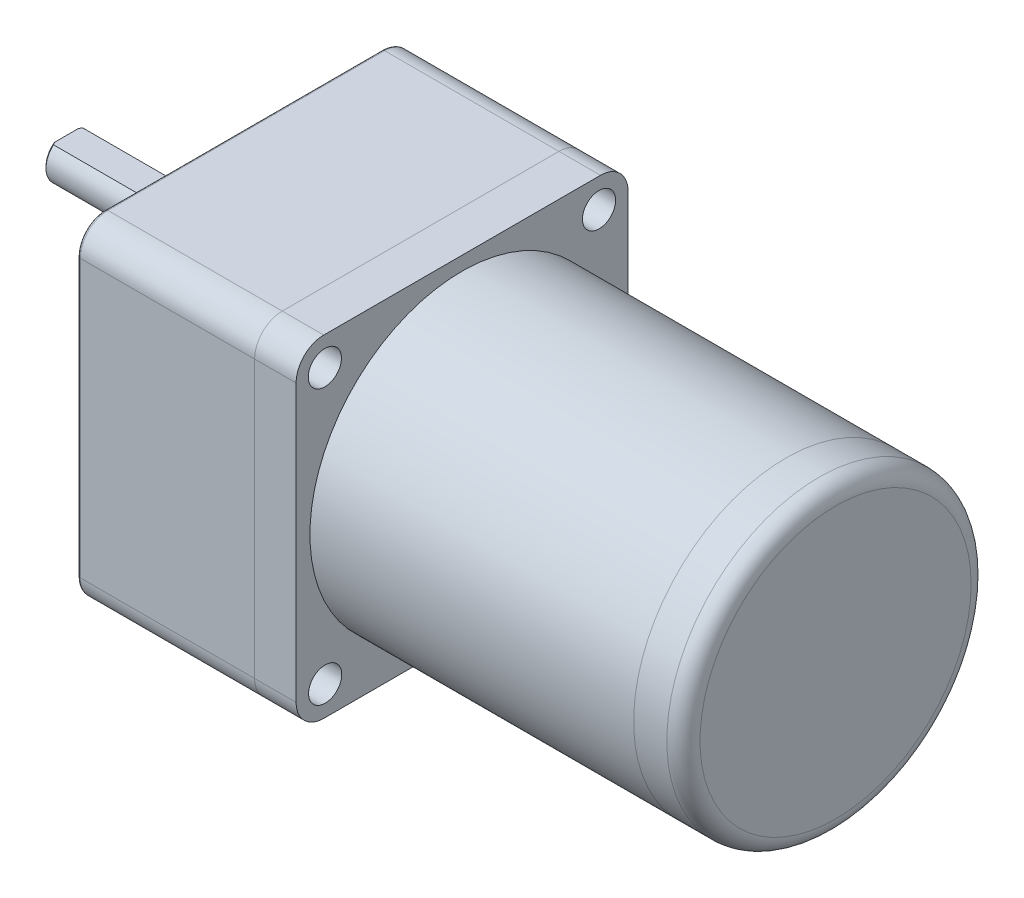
ISO-10303-21;
HEADER;
FILE_DESCRIPTION(('STEP AP214'),'2;1');
FILE_NAME('part.step','',(''),(''),'','','');
FILE_SCHEMA(('AUTOMOTIVE_DESIGN { 1 0 10303 214 1 1 1 1 }'));
ENDSEC;
DATA;
#1=APPLICATION_CONTEXT('core data for automotive mechanical design processes');
#2=APPLICATION_PROTOCOL_DEFINITION('international standard','automotive_design',2000,#1);
#3=PRODUCT_CONTEXT('',#1,'mechanical');
#4=PRODUCT('Part','Part','',(#3));
#5=PRODUCT_RELATED_PRODUCT_CATEGORY('part','',(#4));
#6=PRODUCT_DEFINITION_FORMATION('','',#4);
#7=PRODUCT_DEFINITION_CONTEXT('part definition',#1,'design');
#8=PRODUCT_DEFINITION('design','',#6,#7);
#9=PRODUCT_DEFINITION_SHAPE('','',#8);
#10=(LENGTH_UNIT() NAMED_UNIT(*) SI_UNIT(.MILLI.,.METRE.));
#11=(NAMED_UNIT(*) PLANE_ANGLE_UNIT() SI_UNIT($,.RADIAN.));
#12=(NAMED_UNIT(*) SI_UNIT($,.STERADIAN.) SOLID_ANGLE_UNIT());
#13=UNCERTAINTY_MEASURE_WITH_UNIT(LENGTH_MEASURE(1.E-05),#10,'distance_accuracy_value','');
#14=(GEOMETRIC_REPRESENTATION_CONTEXT(3) GLOBAL_UNCERTAINTY_ASSIGNED_CONTEXT((#13)) GLOBAL_UNIT_ASSIGNED_CONTEXT((#10,
#11,#12)) REPRESENTATION_CONTEXT('',''));
#15=CARTESIAN_POINT('',(0.,0.,0.));
#16=DIRECTION('',(0.,0.,1.));
#17=DIRECTION('',(1.,0.,0.));
#18=AXIS2_PLACEMENT_3D('',#15,#16,#17);
#19=CARTESIAN_POINT('',(-32.,10.,0.));
#20=DIRECTION('',(1.,0.,0.));
#21=DIRECTION('',(0.,0.,-1.));
#22=AXIS2_PLACEMENT_3D('',#19,#20,#21);
#23=CYLINDRICAL_SURFACE('',#22,4.);
#24=DIRECTION('',(-1.,0.,0.));
#25=VECTOR('',#24,1.);
#26=CARTESIAN_POINT('',(-7.,13.,2.64575131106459));
#27=LINE('',#26,#25);
#28=CARTESIAN_POINT('',(-7.,13.,2.64575131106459));
#29=VERTEX_POINT('',#28);
#30=CARTESIAN_POINT('',(-31.7,13.,2.64575131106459));
#31=VERTEX_POINT('',#30);
#32=EDGE_CURVE('E91',#29,#31,#27,.T.);
#33=ORIENTED_EDGE('',*,*,#32,.T.);
#34=CARTESIAN_POINT('',(-31.7,10.,0.));
#35=DIRECTION('',(-1.,0.,0.));
#36=DIRECTION('',(0.,0.,1.));
#37=AXIS2_PLACEMENT_3D('',#34,#35,#36);
#38=CIRCLE('',#37,4.);
#39=CARTESIAN_POINT('',(-31.7,13.,-2.64575131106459));
#40=VERTEX_POINT('',#39);
#41=EDGE_CURVE('E12',#31,#40,#38,.F.);
#42=ORIENTED_EDGE('',*,*,#41,.T.);
#43=DIRECTION('',(-1.,0.,0.));
#44=VECTOR('',#43,1.);
#45=CARTESIAN_POINT('',(-7.,13.,-2.64575131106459));
#46=LINE('',#45,#44);
#47=CARTESIAN_POINT('',(-7.,13.,-2.64575131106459));
#48=VERTEX_POINT('',#47);
#49=EDGE_CURVE('E89',#48,#40,#46,.T.);
#50=ORIENTED_EDGE('',*,*,#49,.F.);
#51=CARTESIAN_POINT('',(-7.,10.,0.));
#52=DIRECTION('',(-1.,0.,0.));
#53=DIRECTION('',(0.,0.,1.));
#54=AXIS2_PLACEMENT_3D('',#51,#52,#53);
#55=CIRCLE('',#54,4.);
#56=EDGE_CURVE('E82',#29,#48,#55,.T.);
#57=ORIENTED_EDGE('',*,*,#56,.F.);
#58=EDGE_LOOP('',(#33,#42,#50,#57));
#59=FACE_BOUND('',#58,.T.);
#60=CARTESIAN_POINT('',(-3.,10.,0.));
#61=DIRECTION('',(-1.,0.,0.));
#62=DIRECTION('',(0.,0.,1.));
#63=AXIS2_PLACEMENT_3D('',#60,#61,#62);
#64=CIRCLE('',#63,4.);
#65=CARTESIAN_POINT('',(-3.,10.,4.));
#66=VERTEX_POINT('',#65);
#67=EDGE_CURVE('E95',#66,#66,#64,.T.);
#68=ORIENTED_EDGE('',*,*,#67,.T.);
#69=EDGE_LOOP('',(#68));
#70=FACE_BOUND('',#69,.T.);
#71=ADVANCED_FACE('F48',(#59,#70),#23,.T.);
#72=CARTESIAN_POINT('',(-32.,10.,0.));
#73=DIRECTION('',(-1.,0.,0.));
#74=DIRECTION('',(0.,0.,1.));
#75=AXIS2_PLACEMENT_3D('',#72,#73,#74);
#76=PLANE('',#75);
#77=DIRECTION('',(0.,0.,1.));
#78=VECTOR('',#77,1.);
#79=CARTESIAN_POINT('',(-32.,13.,2.64575131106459));
#80=LINE('',#79,#78);
#81=CARTESIAN_POINT('',(-32.,13.,-2.16564078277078));
#82=VERTEX_POINT('',#81);
#83=CARTESIAN_POINT('',(-32.,13.,2.16564078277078));
#84=VERTEX_POINT('',#83);
#85=EDGE_CURVE('E86',#82,#84,#80,.T.);
#86=ORIENTED_EDGE('',*,*,#85,.F.);
#87=CARTESIAN_POINT('',(-32.,10.,0.));
#88=DIRECTION('',(-1.,0.,0.));
#89=DIRECTION('',(0.,0.,1.));
#90=AXIS2_PLACEMENT_3D('',#87,#88,#89);
#91=CIRCLE('',#90,3.70000000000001);
#92=EDGE_CURVE('E101',#82,#84,#91,.T.);
#93=ORIENTED_EDGE('',*,*,#92,.T.);
#94=EDGE_LOOP('',(#86,#93));
#95=FACE_BOUND('',#94,.T.);
#96=ADVANCED_FACE('F117',(#95),#76,.T.);
#97=CARTESIAN_POINT('',(-3.,10.,0.));
#98=DIRECTION('',(-1.,0.,0.));
#99=DIRECTION('',(0.,0.,1.));
#100=AXIS2_PLACEMENT_3D('',#97,#98,#99);
#101=PLANE('',#100);
#102=ORIENTED_EDGE('',*,*,#67,.F.);
#103=EDGE_LOOP('',(#102));
#104=FACE_BOUND('',#103,.T.);
#105=ADVANCED_FACE('F116',(#104),#101,.F.);
#106=CARTESIAN_POINT('',(-7.,13.,2.64575131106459));
#107=DIRECTION('',(0.,-1.,0.));
#108=DIRECTION('',(0.,0.,-1.));
#109=AXIS2_PLACEMENT_3D('',#106,#107,#108);
#110=PLANE('',#109);
#111=ORIENTED_EDGE('',*,*,#85,.T.);
#112=CARTESIAN_POINT('',(-32.,13.,2.16564078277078));
#113=CARTESIAN_POINT('',(-31.9761619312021,13.,2.20636622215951));
#114=CARTESIAN_POINT('',(-31.95199678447,13.,2.2468991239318));
#115=CARTESIAN_POINT('',(-31.9030718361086,13.,2.32759423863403));
#116=CARTESIAN_POINT('',(-31.8783121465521,13.,2.36775651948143));
#117=CARTESIAN_POINT('',(-31.8282492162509,13.,2.44773910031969));
#118=CARTESIAN_POINT('',(-31.80294598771,13.,2.48755940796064));
#119=CARTESIAN_POINT('',(-31.7518371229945,13.,2.56688695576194));
#120=CARTESIAN_POINT('',(-31.7260313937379,13.,2.60639413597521));
#121=CARTESIAN_POINT('',(-31.7000000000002,13.,2.64575131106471));
#122=B_SPLINE_CURVE_WITH_KNOTS('',3,(#112,#113,#114,#115,#116,#117,#118,#119,#120,#121),
.UNSPECIFIED.,.F.,.F.,(4,2,2,2,4),(0.,0.141564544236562,0.28310260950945,0.424637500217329,
0.566198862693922),.UNSPECIFIED.);
#123=EDGE_CURVE('E57',#84,#31,#122,.T.);
#124=ORIENTED_EDGE('',*,*,#123,.T.);
#125=ORIENTED_EDGE('',*,*,#32,.F.);
#126=DIRECTION('',(0.,0.,1.));
#127=VECTOR('',#126,1.);
#128=CARTESIAN_POINT('',(-7.,13.,2.64575131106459));
#129=LINE('',#128,#127);
#130=EDGE_CURVE('E85',#48,#29,#129,.T.);
#131=ORIENTED_EDGE('',*,*,#130,.F.);
#132=ORIENTED_EDGE('',*,*,#49,.T.);
#133=CARTESIAN_POINT('',(-31.7,13.,-2.64575131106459));
#134=CARTESIAN_POINT('',(-31.7260313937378,13.,-2.60639413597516));
#135=CARTESIAN_POINT('',(-31.7518371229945,13.,-2.56688695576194));
#136=CARTESIAN_POINT('',(-31.80294598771,13.,-2.48755940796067));
#137=CARTESIAN_POINT('',(-31.8282492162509,13.,-2.44773910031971));
#138=CARTESIAN_POINT('',(-31.878312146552,13.,-2.36775651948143));
#139=CARTESIAN_POINT('',(-31.9030718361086,13.,-2.32759423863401));
#140=CARTESIAN_POINT('',(-31.9519967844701,13.,-2.24689912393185));
#141=CARTESIAN_POINT('',(-31.9761619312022,13.,-2.20636622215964));
#142=CARTESIAN_POINT('',(-32.0000000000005,13.,-2.16564078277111));
#143=B_SPLINE_CURVE_WITH_KNOTS('',3,(#133,#134,#135,#136,#137,#138,#139,#140,#141,#142),
.UNSPECIFIED.,.F.,.F.,(4,2,2,2,4),(0.,0.141561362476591,0.283096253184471,0.424634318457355,
0.566198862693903),.UNSPECIFIED.);
#144=EDGE_CURVE('E104',#40,#82,#143,.T.);
#145=ORIENTED_EDGE('',*,*,#144,.T.);
#146=EDGE_LOOP('',(#111,#124,#125,#131,#132,#145));
#147=FACE_BOUND('',#146,.T.);
#148=ADVANCED_FACE('F88',(#147),#110,.F.);
#149=CARTESIAN_POINT('',(-7.,10.,0.));
#150=DIRECTION('',(-1.,0.,0.));
#151=DIRECTION('',(0.,0.,1.));
#152=AXIS2_PLACEMENT_3D('',#149,#150,#151);
#153=PLANE('',#152);
#154=ORIENTED_EDGE('',*,*,#56,.T.);
#155=ORIENTED_EDGE('',*,*,#130,.T.);
#156=EDGE_LOOP('',(#154,#155));
#157=FACE_BOUND('',#156,.T.);
#158=ADVANCED_FACE('F84',(#157),#153,.T.);
#159=CARTESIAN_POINT('',(-32.,10.,0.));
#160=DIRECTION('',(1.,0.,0.));
#161=DIRECTION('',(0.,0.,-1.));
#162=AXIS2_PLACEMENT_3D('',#159,#160,#161);
#163=CONICAL_SURFACE('',#162,3.70000000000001,0.785398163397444);
#164=ORIENTED_EDGE('',*,*,#144,.F.);
#165=ORIENTED_EDGE('',*,*,#41,.F.);
#166=ORIENTED_EDGE('',*,*,#123,.F.);
#167=ORIENTED_EDGE('',*,*,#92,.F.);
#168=EDGE_LOOP('',(#164,#165,#166,#167));
#169=FACE_BOUND('',#168,.T.);
#170=ADVANCED_FACE('F50',(#169),#163,.T.);
#171=CLOSED_SHELL('',(#71,#96,#105,#148,#158,#170));
#172=MANIFOLD_SOLID_BREP('B2',#171);
#173=CARTESIAN_POINT('',(-3.,10.,0.));
#174=DIRECTION('',(1.,0.,0.));
#175=DIRECTION('',(0.,0.,-1.));
#176=AXIS2_PLACEMENT_3D('',#173,#174,#175);
#177=CYLINDRICAL_SURFACE('',#176,12.);
#178=CARTESIAN_POINT('',(-2.5,10.,0.));
#179=DIRECTION('',(-1.,0.,0.));
#180=DIRECTION('',(0.,0.,1.));
#181=AXIS2_PLACEMENT_3D('',#178,#179,#180);
#182=CIRCLE('',#181,12.);
#183=CARTESIAN_POINT('',(-2.5,10.,12.));
#184=VERTEX_POINT('',#183);
#185=EDGE_CURVE('E47',#184,#184,#182,.F.);
#186=ORIENTED_EDGE('',*,*,#185,.T.);
#187=EDGE_LOOP('',(#186));
#188=FACE_BOUND('',#187,.T.);
#189=CARTESIAN_POINT('',(0.,10.,0.));
#190=DIRECTION('',(-1.,0.,0.));
#191=DIRECTION('',(0.,0.,1.));
#192=AXIS2_PLACEMENT_3D('',#189,#190,#191);
#193=CIRCLE('',#192,12.);
#194=CARTESIAN_POINT('',(0.,10.,12.));
#195=VERTEX_POINT('',#194);
#196=EDGE_CURVE('E190',#195,#195,#193,.T.);
#197=ORIENTED_EDGE('',*,*,#196,.T.);
#198=EDGE_LOOP('',(#197));
#199=FACE_BOUND('',#198,.T.);
#200=ADVANCED_FACE('F179',(#188,#199),#177,.T.);
#201=CARTESIAN_POINT('',(-3.,10.,0.));
#202=DIRECTION('',(-1.,0.,0.));
#203=DIRECTION('',(0.,0.,1.));
#204=AXIS2_PLACEMENT_3D('',#201,#202,#203);
#205=PLANE('',#204);
#206=CARTESIAN_POINT('',(-3.,10.,0.));
#207=DIRECTION('',(-1.,0.,0.));
#208=DIRECTION('',(0.,0.,1.));
#209=AXIS2_PLACEMENT_3D('',#206,#207,#208);
#210=CIRCLE('',#209,11.5);
#211=CARTESIAN_POINT('',(-3.,10.,11.5));
#212=VERTEX_POINT('',#211);
#213=EDGE_CURVE('E186',#212,#212,#210,.T.);
#214=ORIENTED_EDGE('',*,*,#213,.T.);
#215=EDGE_LOOP('',(#214));
#216=FACE_BOUND('',#215,.T.);
#217=ADVANCED_FACE('F200',(#216),#205,.T.);
#218=CARTESIAN_POINT('',(0.,10.,0.));
#219=DIRECTION('',(-1.,0.,0.));
#220=DIRECTION('',(0.,0.,1.));
#221=AXIS2_PLACEMENT_3D('',#218,#219,#220);
#222=PLANE('',#221);
#223=ORIENTED_EDGE('',*,*,#196,.F.);
#224=EDGE_LOOP('',(#223));
#225=FACE_BOUND('',#224,.T.);
#226=ADVANCED_FACE('F198',(#225),#222,.F.);
#227=CARTESIAN_POINT('',(-2.5,10.,0.));
#228=DIRECTION('',(-1.,0.,0.));
#229=DIRECTION('',(0.,0.,1.));
#230=AXIS2_PLACEMENT_3D('',#227,#228,#229);
#231=TOROIDAL_SURFACE('',#230,11.5,0.5);
#232=ORIENTED_EDGE('',*,*,#185,.F.);
#233=EDGE_LOOP('',(#232));
#234=FACE_BOUND('',#233,.T.);
#235=ORIENTED_EDGE('',*,*,#213,.F.);
#236=EDGE_LOOP('',(#235));
#237=FACE_BOUND('',#236,.T.);
#238=ADVANCED_FACE('F181',(#234,#237),#231,.T.);
#239=CLOSED_SHELL('',(#200,#217,#226,#238));
#240=MANIFOLD_SOLID_BREP('B6',#239);
#241=CARTESIAN_POINT('',(107.,0.,0.));
#242=DIRECTION('',(-1.,0.,0.));
#243=DIRECTION('',(0.,0.,1.));
#244=AXIS2_PLACEMENT_3D('',#241,#242,#243);
#245=CYLINDRICAL_SURFACE('',#244,27.5);
#246=CARTESIAN_POINT('',(104.,0.,0.));
#247=DIRECTION('',(1.,0.,0.));
#248=DIRECTION('',(0.,0.,-1.));
#249=AXIS2_PLACEMENT_3D('',#246,#247,#248);
#250=CIRCLE('',#249,27.5);
#251=CARTESIAN_POINT('',(104.,0.,-27.5));
#252=VERTEX_POINT('',#251);
#253=EDGE_CURVE('E178',#252,#252,#250,.F.);
#254=ORIENTED_EDGE('',*,*,#253,.T.);
#255=EDGE_LOOP('',(#254));
#256=FACE_BOUND('',#255,.T.);
#257=CARTESIAN_POINT('',(98.,0.,0.));
#258=DIRECTION('',(1.,0.,0.));
#259=DIRECTION('',(0.,0.,-1.));
#260=AXIS2_PLACEMENT_3D('',#257,#258,#259);
#261=CIRCLE('',#260,27.5);
#262=CARTESIAN_POINT('',(98.,0.,-27.5));
#263=VERTEX_POINT('',#262);
#264=EDGE_CURVE('E254',#263,#263,#261,.T.);
#265=ORIENTED_EDGE('',*,*,#264,.T.);
#266=EDGE_LOOP('',(#265));
#267=FACE_BOUND('',#266,.T.);
#268=ADVANCED_FACE('F243',(#256,#267),#245,.T.);
#269=CARTESIAN_POINT('',(107.,0.,0.));
#270=DIRECTION('',(1.,0.,0.));
#271=DIRECTION('',(0.,0.,-1.));
#272=AXIS2_PLACEMENT_3D('',#269,#270,#271);
#273=PLANE('',#272);
#274=CARTESIAN_POINT('',(107.,0.,0.));
#275=DIRECTION('',(1.,0.,0.));
#276=DIRECTION('',(0.,0.,-1.));
#277=AXIS2_PLACEMENT_3D('',#274,#275,#276);
#278=CIRCLE('',#277,24.5);
#279=CARTESIAN_POINT('',(107.,0.,-24.5));
#280=VERTEX_POINT('',#279);
#281=EDGE_CURVE('E250',#280,#280,#278,.T.);
#282=ORIENTED_EDGE('',*,*,#281,.T.);
#283=EDGE_LOOP('',(#282));
#284=FACE_BOUND('',#283,.T.);
#285=ADVANCED_FACE('F264',(#284),#273,.T.);
#286=CARTESIAN_POINT('',(98.,0.,0.));
#287=DIRECTION('',(1.,0.,0.));
#288=DIRECTION('',(0.,0.,-1.));
#289=AXIS2_PLACEMENT_3D('',#286,#287,#288);
#290=PLANE('',#289);
#291=ORIENTED_EDGE('',*,*,#264,.F.);
#292=EDGE_LOOP('',(#291));
#293=FACE_BOUND('',#292,.T.);
#294=ADVANCED_FACE('F262',(#293),#290,.F.);
#295=CARTESIAN_POINT('',(104.,0.,0.));
#296=DIRECTION('',(1.,0.,0.));
#297=DIRECTION('',(0.,0.,-1.));
#298=AXIS2_PLACEMENT_3D('',#295,#296,#297);
#299=TOROIDAL_SURFACE('',#298,24.5,3.);
#300=ORIENTED_EDGE('',*,*,#253,.F.);
#301=EDGE_LOOP('',(#300));
#302=FACE_BOUND('',#301,.T.);
#303=ORIENTED_EDGE('',*,*,#281,.F.);
#304=EDGE_LOOP('',(#303));
#305=FACE_BOUND('',#304,.T.);
#306=ADVANCED_FACE('F245',(#302,#305),#299,.T.);
#307=CLOSED_SHELL('',(#268,#285,#294,#306));
#308=MANIFOLD_SOLID_BREP('B42',#307);
#309=CARTESIAN_POINT('',(98.,0.,0.));
#310=DIRECTION('',(-1.,0.,0.));
#311=DIRECTION('',(0.,0.,1.));
#312=AXIS2_PLACEMENT_3D('',#309,#310,#311);
#313=CYLINDRICAL_SURFACE('',#312,27.5);
#314=CARTESIAN_POINT('',(98.,0.,0.));
#315=DIRECTION('',(1.,0.,0.));
#316=DIRECTION('',(0.,0.,-1.));
#317=AXIS2_PLACEMENT_3D('',#314,#315,#316);
#318=CIRCLE('',#317,27.5);
#319=CARTESIAN_POINT('',(98.,0.,-27.5));
#320=VERTEX_POINT('',#319);
#321=EDGE_CURVE('E242',#320,#320,#318,.T.);
#322=ORIENTED_EDGE('',*,*,#321,.F.);
#323=EDGE_LOOP('',(#322));
#324=FACE_BOUND('',#323,.T.);
#325=CARTESIAN_POINT('',(39.5,0.,0.));
#326=DIRECTION('',(1.,0.,0.));
#327=DIRECTION('',(0.,0.,-1.));
#328=AXIS2_PLACEMENT_3D('',#325,#326,#327);
#329=CIRCLE('',#328,27.5);
#330=CARTESIAN_POINT('',(39.5,0.,-27.5));
#331=VERTEX_POINT('',#330);
#332=EDGE_CURVE('E312',#331,#331,#329,.T.);
#333=ORIENTED_EDGE('',*,*,#332,.T.);
#334=EDGE_LOOP('',(#333));
#335=FACE_BOUND('',#334,.T.);
#336=ADVANCED_FACE('F309',(#324,#335),#313,.T.);
#337=CARTESIAN_POINT('',(98.,0.,0.));
#338=DIRECTION('',(1.,0.,0.));
#339=DIRECTION('',(0.,0.,-1.));
#340=AXIS2_PLACEMENT_3D('',#337,#338,#339);
#341=PLANE('',#340);
#342=ORIENTED_EDGE('',*,*,#321,.T.);
#343=EDGE_LOOP('',(#342));
#344=FACE_BOUND('',#343,.T.);
#345=ADVANCED_FACE('F324',(#344),#341,.T.);
#346=CARTESIAN_POINT('',(39.5,0.,0.));
#347=DIRECTION('',(1.,0.,0.));
#348=DIRECTION('',(0.,0.,-1.));
#349=AXIS2_PLACEMENT_3D('',#346,#347,#348);
#350=PLANE('',#349);
#351=ORIENTED_EDGE('',*,*,#332,.F.);
#352=EDGE_LOOP('',(#351));
#353=FACE_BOUND('',#352,.T.);
#354=ADVANCED_FACE('F322',(#353),#350,.F.);
#355=CLOSED_SHELL('',(#336,#345,#354));
#356=MANIFOLD_SOLID_BREP('B173',#355);
#357=CARTESIAN_POINT('',(39.5,25.,-25.));
#358=DIRECTION('',(-1.,0.,0.));
#359=DIRECTION('',(0.,0.,1.));
#360=AXIS2_PLACEMENT_3D('',#357,#358,#359);
#361=CYLINDRICAL_SURFACE('',#360,5.);
#362=CARTESIAN_POINT('',(32.,25.,-25.));
#363=DIRECTION('',(1.,0.,0.));
#364=DIRECTION('',(0.,0.,1.));
#365=AXIS2_PLACEMENT_3D('',#362,#363,#364);
#366=CIRCLE('',#365,5.);
#367=CARTESIAN_POINT('',(32.,25.,-30.));
#368=VERTEX_POINT('',#367);
#369=CARTESIAN_POINT('',(32.,30.,-25.));
#370=VERTEX_POINT('',#369);
#371=EDGE_CURVE('E457',#368,#370,#366,.T.);
#372=ORIENTED_EDGE('',*,*,#371,.T.);
#373=DIRECTION('',(-1.,0.,0.));
#374=VECTOR('',#373,1.);
#375=CARTESIAN_POINT('',(39.5,30.,-25.));
#376=LINE('',#375,#374);
#377=CARTESIAN_POINT('',(39.5,30.,-25.));
#378=VERTEX_POINT('',#377);
#379=EDGE_CURVE('E307',#378,#370,#376,.T.);
#380=ORIENTED_EDGE('',*,*,#379,.F.);
#381=CARTESIAN_POINT('',(39.5,25.,-25.));
#382=DIRECTION('',(1.,0.,0.));
#383=DIRECTION('',(0.,0.,1.));
#384=AXIS2_PLACEMENT_3D('',#381,#382,#383);
#385=CIRCLE('',#384,5.);
#386=CARTESIAN_POINT('',(39.5,25.,-30.));
#387=VERTEX_POINT('',#386);
#388=EDGE_CURVE('E471',#387,#378,#385,.T.);
#389=ORIENTED_EDGE('',*,*,#388,.F.);
#390=DIRECTION('',(-1.,0.,0.));
#391=VECTOR('',#390,1.);
#392=CARTESIAN_POINT('',(39.5,25.,-30.));
#393=LINE('',#392,#391);
#394=EDGE_CURVE('E453',#387,#368,#393,.T.);
#395=ORIENTED_EDGE('',*,*,#394,.T.);
#396=EDGE_LOOP('',(#372,#380,#389,#395));
#397=FACE_BOUND('',#396,.T.);
#398=ADVANCED_FACE('F359',(#397),#361,.T.);
#399=CARTESIAN_POINT('',(39.5,30.,25.));
#400=DIRECTION('',(0.,-1.,0.));
#401=DIRECTION('',(0.,0.,-1.));
#402=AXIS2_PLACEMENT_3D('',#399,#400,#401);
#403=PLANE('',#402);
#404=DIRECTION('',(0.,0.,1.));
#405=VECTOR('',#404,1.);
#406=CARTESIAN_POINT('',(32.,30.,25.));
#407=LINE('',#406,#405);
#408=CARTESIAN_POINT('',(32.,30.,25.));
#409=VERTEX_POINT('',#408);
#410=EDGE_CURVE('E460',#370,#409,#407,.T.);
#411=ORIENTED_EDGE('',*,*,#410,.T.);
#412=DIRECTION('',(-1.,0.,0.));
#413=VECTOR('',#412,1.);
#414=CARTESIAN_POINT('',(39.5,30.,25.));
#415=LINE('',#414,#413);
#416=CARTESIAN_POINT('',(39.5,30.,25.));
#417=VERTEX_POINT('',#416);
#418=EDGE_CURVE('E368',#417,#409,#415,.T.);
#419=ORIENTED_EDGE('',*,*,#418,.F.);
#420=DIRECTION('',(0.,0.,1.));
#421=VECTOR('',#420,1.);
#422=CARTESIAN_POINT('',(39.5,30.,25.));
#423=LINE('',#422,#421);
#424=EDGE_CURVE('E420',#378,#417,#423,.T.);
#425=ORIENTED_EDGE('',*,*,#424,.F.);
#426=ORIENTED_EDGE('',*,*,#379,.T.);
#427=EDGE_LOOP('',(#411,#419,#425,#426));
#428=FACE_BOUND('',#427,.T.);
#429=ADVANCED_FACE('F525',(#428),#403,.F.);
#430=CARTESIAN_POINT('',(39.5,25.,25.));
#431=DIRECTION('',(-1.,0.,0.));
#432=DIRECTION('',(0.,0.,1.));
#433=AXIS2_PLACEMENT_3D('',#430,#431,#432);
#434=CYLINDRICAL_SURFACE('',#433,5.);
#435=CARTESIAN_POINT('',(32.,25.,25.));
#436=DIRECTION('',(1.,0.,0.));
#437=DIRECTION('',(0.,0.,1.));
#438=AXIS2_PLACEMENT_3D('',#435,#436,#437);
#439=CIRCLE('',#438,5.);
#440=CARTESIAN_POINT('',(32.,25.,30.));
#441=VERTEX_POINT('',#440);
#442=EDGE_CURVE('E462',#409,#441,#439,.T.);
#443=ORIENTED_EDGE('',*,*,#442,.T.);
#444=DIRECTION('',(-1.,0.,0.));
#445=VECTOR('',#444,1.);
#446=CARTESIAN_POINT('',(39.5,25.,30.));
#447=LINE('',#446,#445);
#448=CARTESIAN_POINT('',(39.5,25.,30.));
#449=VERTEX_POINT('',#448);
#450=EDGE_CURVE('E478',#449,#441,#447,.T.);
#451=ORIENTED_EDGE('',*,*,#450,.F.);
#452=CARTESIAN_POINT('',(39.5,25.,25.));
#453=DIRECTION('',(1.,0.,0.));
#454=DIRECTION('',(0.,0.,1.));
#455=AXIS2_PLACEMENT_3D('',#452,#453,#454);
#456=CIRCLE('',#455,5.);
#457=EDGE_CURVE('E626',#417,#449,#456,.T.);
#458=ORIENTED_EDGE('',*,*,#457,.F.);
#459=ORIENTED_EDGE('',*,*,#418,.T.);
#460=EDGE_LOOP('',(#443,#451,#458,#459));
#461=FACE_BOUND('',#460,.T.);
#462=ADVANCED_FACE('F529',(#461),#434,.T.);
#463=CARTESIAN_POINT('',(39.5,-25.,30.));
#464=DIRECTION('',(0.,0.,-1.));
#465=DIRECTION('',(-1.,0.,0.));
#466=AXIS2_PLACEMENT_3D('',#463,#464,#465);
#467=PLANE('',#466);
#468=DIRECTION('',(0.,-1.,0.));
#469=VECTOR('',#468,1.);
#470=CARTESIAN_POINT('',(32.,-25.,30.));
#471=LINE('',#470,#469);
#472=CARTESIAN_POINT('',(32.,-25.,30.));
#473=VERTEX_POINT('',#472);
#474=EDGE_CURVE('E464',#441,#473,#471,.T.);
#475=ORIENTED_EDGE('',*,*,#474,.T.);
#476=DIRECTION('',(-1.,0.,0.));
#477=VECTOR('',#476,1.);
#478=CARTESIAN_POINT('',(39.5,-25.,30.));
#479=LINE('',#478,#477);
#480=CARTESIAN_POINT('',(39.5,-25.,30.));
#481=VERTEX_POINT('',#480);
#482=EDGE_CURVE('E475',#481,#473,#479,.T.);
#483=ORIENTED_EDGE('',*,*,#482,.F.);
#484=DIRECTION('',(0.,-1.,0.));
#485=VECTOR('',#484,1.);
#486=CARTESIAN_POINT('',(39.5,-25.,30.));
#487=LINE('',#486,#485);
#488=EDGE_CURVE('E628',#449,#481,#487,.T.);
#489=ORIENTED_EDGE('',*,*,#488,.F.);
#490=ORIENTED_EDGE('',*,*,#450,.T.);
#491=EDGE_LOOP('',(#475,#483,#489,#490));
#492=FACE_BOUND('',#491,.T.);
#493=ADVANCED_FACE('F533',(#492),#467,.F.);
#494=CARTESIAN_POINT('',(39.5,-25.,25.));
#495=DIRECTION('',(-1.,0.,0.));
#496=DIRECTION('',(0.,0.,1.));
#497=AXIS2_PLACEMENT_3D('',#494,#495,#496);
#498=CYLINDRICAL_SURFACE('',#497,5.);
#499=CARTESIAN_POINT('',(32.,-25.,25.));
#500=DIRECTION('',(1.,0.,0.));
#501=DIRECTION('',(0.,0.,1.));
#502=AXIS2_PLACEMENT_3D('',#499,#500,#501);
#503=CIRCLE('',#502,5.);
#504=CARTESIAN_POINT('',(32.,-30.,25.));
#505=VERTEX_POINT('',#504);
#506=EDGE_CURVE('E466',#473,#505,#503,.T.);
#507=ORIENTED_EDGE('',*,*,#506,.T.);
#508=DIRECTION('',(-1.,0.,0.));
#509=VECTOR('',#508,1.);
#510=CARTESIAN_POINT('',(39.5,-30.,25.));
#511=LINE('',#510,#509);
#512=CARTESIAN_POINT('',(39.5,-30.,25.));
#513=VERTEX_POINT('',#512);
#514=EDGE_CURVE('E448',#513,#505,#511,.T.);
#515=ORIENTED_EDGE('',*,*,#514,.F.);
#516=CARTESIAN_POINT('',(39.5,-25.,25.));
#517=DIRECTION('',(1.,0.,0.));
#518=DIRECTION('',(0.,0.,1.));
#519=AXIS2_PLACEMENT_3D('',#516,#517,#518);
#520=CIRCLE('',#519,5.);
#521=EDGE_CURVE('E439',#481,#513,#520,.T.);
#522=ORIENTED_EDGE('',*,*,#521,.F.);
#523=ORIENTED_EDGE('',*,*,#482,.T.);
#524=EDGE_LOOP('',(#507,#515,#522,#523));
#525=FACE_BOUND('',#524,.T.);
#526=ADVANCED_FACE('F539',(#525),#498,.T.);
#527=CARTESIAN_POINT('',(39.5,-30.,25.));
#528=DIRECTION('',(0.,1.,0.));
#529=DIRECTION('',(0.,0.,1.));
#530=AXIS2_PLACEMENT_3D('',#527,#528,#529);
#531=PLANE('',#530);
#532=DIRECTION('',(0.,0.,-1.));
#533=VECTOR('',#532,1.);
#534=CARTESIAN_POINT('',(32.,-30.,25.));
#535=LINE('',#534,#533);
#536=CARTESIAN_POINT('',(32.,-30.,-25.));
#537=VERTEX_POINT('',#536);
#538=EDGE_CURVE('E447',#505,#537,#535,.T.);
#539=ORIENTED_EDGE('',*,*,#538,.T.);
#540=DIRECTION('',(-1.,0.,0.));
#541=VECTOR('',#540,1.);
#542=CARTESIAN_POINT('',(39.5,-30.,-25.));
#543=LINE('',#542,#541);
#544=CARTESIAN_POINT('',(39.5,-30.,-25.));
#545=VERTEX_POINT('',#544);
#546=EDGE_CURVE('E444',#545,#537,#543,.T.);
#547=ORIENTED_EDGE('',*,*,#546,.F.);
#548=DIRECTION('',(0.,0.,-1.));
#549=VECTOR('',#548,1.);
#550=CARTESIAN_POINT('',(39.5,-30.,25.));
#551=LINE('',#550,#549);
#552=EDGE_CURVE('E433',#513,#545,#551,.T.);
#553=ORIENTED_EDGE('',*,*,#552,.F.);
#554=ORIENTED_EDGE('',*,*,#514,.T.);
#555=EDGE_LOOP('',(#539,#547,#553,#554));
#556=FACE_BOUND('',#555,.T.);
#557=ADVANCED_FACE('F445',(#556),#531,.F.);
#558=CARTESIAN_POINT('',(39.5,-25.,-25.));
#559=DIRECTION('',(-1.,0.,0.));
#560=DIRECTION('',(0.,0.,1.));
#561=AXIS2_PLACEMENT_3D('',#558,#559,#560);
#562=CYLINDRICAL_SURFACE('',#561,5.);
#563=CARTESIAN_POINT('',(32.,-25.,-25.));
#564=DIRECTION('',(1.,0.,0.));
#565=DIRECTION('',(0.,0.,-1.));
#566=AXIS2_PLACEMENT_3D('',#563,#564,#565);
#567=CIRCLE('',#566,5.);
#568=CARTESIAN_POINT('',(32.,-25.,-30.));
#569=VERTEX_POINT('',#568);
#570=EDGE_CURVE('E406',#537,#569,#567,.T.);
#571=ORIENTED_EDGE('',*,*,#570,.T.);
#572=DIRECTION('',(-1.,0.,0.));
#573=VECTOR('',#572,1.);
#574=CARTESIAN_POINT('',(39.5,-25.,-30.));
#575=LINE('',#574,#573);
#576=CARTESIAN_POINT('',(39.5,-25.,-30.));
#577=VERTEX_POINT('',#576);
#578=EDGE_CURVE('E449',#577,#569,#575,.T.);
#579=ORIENTED_EDGE('',*,*,#578,.F.);
#580=CARTESIAN_POINT('',(39.5,-25.,-25.));
#581=DIRECTION('',(1.,0.,0.));
#582=DIRECTION('',(0.,0.,-1.));
#583=AXIS2_PLACEMENT_3D('',#580,#581,#582);
#584=CIRCLE('',#583,5.);
#585=EDGE_CURVE('E437',#545,#577,#584,.T.);
#586=ORIENTED_EDGE('',*,*,#585,.F.);
#587=ORIENTED_EDGE('',*,*,#546,.T.);
#588=EDGE_LOOP('',(#571,#579,#586,#587));
#589=FACE_BOUND('',#588,.T.);
#590=ADVANCED_FACE('F451',(#589),#562,.T.);
#591=CARTESIAN_POINT('',(39.5,-25.,-30.));
#592=DIRECTION('',(0.,0.,1.));
#593=DIRECTION('',(1.,0.,0.));
#594=AXIS2_PLACEMENT_3D('',#591,#592,#593);
#595=PLANE('',#594);
#596=DIRECTION('',(0.,1.,0.));
#597=VECTOR('',#596,1.);
#598=CARTESIAN_POINT('',(32.,-25.,-30.));
#599=LINE('',#598,#597);
#600=EDGE_CURVE('E412',#569,#368,#599,.T.);
#601=ORIENTED_EDGE('',*,*,#600,.T.);
#602=ORIENTED_EDGE('',*,*,#394,.F.);
#603=DIRECTION('',(0.,1.,0.));
#604=VECTOR('',#603,1.);
#605=CARTESIAN_POINT('',(39.5,-25.,-30.));
#606=LINE('',#605,#604);
#607=EDGE_CURVE('E377',#577,#387,#606,.T.);
#608=ORIENTED_EDGE('',*,*,#607,.F.);
#609=ORIENTED_EDGE('',*,*,#578,.T.);
#610=EDGE_LOOP('',(#601,#602,#608,#609));
#611=FACE_BOUND('',#610,.T.);
#612=ADVANCED_FACE('F514',(#611),#595,.F.);
#613=CARTESIAN_POINT('',(39.5,25.,-25.));
#614=DIRECTION('',(-1.,0.,0.));
#615=DIRECTION('',(0.,0.,1.));
#616=AXIS2_PLACEMENT_3D('',#613,#614,#615);
#617=PLANE('',#616);
#618=CARTESIAN_POINT('',(39.5,24.8007290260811,24.8007290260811));
#619=DIRECTION('',(1.,0.,0.));
#620=DIRECTION('',(0.,0.,-1.));
#621=AXIS2_PLACEMENT_3D('',#618,#619,#620);
#622=CIRCLE('',#621,3.);
#623=CARTESIAN_POINT('',(39.5,24.8007290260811,21.8007290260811));
#624=VERTEX_POINT('',#623);
#625=EDGE_CURVE('E487',#624,#624,#622,.T.);
#626=ORIENTED_EDGE('',*,*,#625,.F.);
#627=EDGE_LOOP('',(#626));
#628=FACE_BOUND('',#627,.T.);
#629=CARTESIAN_POINT('',(39.5,24.7487373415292,-24.7487373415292));
#630=DIRECTION('',(1.,0.,0.));
#631=DIRECTION('',(0.,0.,-1.));
#632=AXIS2_PLACEMENT_3D('',#629,#630,#631);
#633=CIRCLE('',#632,3.);
#634=CARTESIAN_POINT('',(39.5,24.7487373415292,-27.7487373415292));
#635=VERTEX_POINT('',#634);
#636=EDGE_CURVE('E612',#635,#635,#633,.T.);
#637=ORIENTED_EDGE('',*,*,#636,.F.);
#638=EDGE_LOOP('',(#637));
#639=FACE_BOUND('',#638,.T.);
#640=CARTESIAN_POINT('',(39.5,-24.7487373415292,-24.7487373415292));
#641=DIRECTION('',(1.,0.,0.));
#642=DIRECTION('',(0.,0.,-1.));
#643=AXIS2_PLACEMENT_3D('',#640,#641,#642);
#644=CIRCLE('',#643,3.);
#645=CARTESIAN_POINT('',(39.5,-24.7487373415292,-27.7487373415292));
#646=VERTEX_POINT('',#645);
#647=EDGE_CURVE('E614',#646,#646,#644,.T.);
#648=ORIENTED_EDGE('',*,*,#647,.F.);
#649=EDGE_LOOP('',(#648));
#650=FACE_BOUND('',#649,.T.);
#651=CARTESIAN_POINT('',(39.5,-24.7487373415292,24.7487373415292));
#652=DIRECTION('',(1.,0.,0.));
#653=DIRECTION('',(0.,0.,-1.));
#654=AXIS2_PLACEMENT_3D('',#651,#652,#653);
#655=CIRCLE('',#654,3.);
#656=CARTESIAN_POINT('',(39.5,-24.7487373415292,21.7487373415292));
#657=VERTEX_POINT('',#656);
#658=EDGE_CURVE('E619',#657,#657,#655,.T.);
#659=ORIENTED_EDGE('',*,*,#658,.F.);
#660=EDGE_LOOP('',(#659));
#661=FACE_BOUND('',#660,.T.);
#662=ORIENTED_EDGE('',*,*,#388,.T.);
#663=ORIENTED_EDGE('',*,*,#424,.T.);
#664=ORIENTED_EDGE('',*,*,#457,.T.);
#665=ORIENTED_EDGE('',*,*,#488,.T.);
#666=ORIENTED_EDGE('',*,*,#521,.T.);
#667=ORIENTED_EDGE('',*,*,#552,.T.);
#668=ORIENTED_EDGE('',*,*,#585,.T.);
#669=ORIENTED_EDGE('',*,*,#607,.T.);
#670=EDGE_LOOP('',(#662,#663,#664,#665,#666,#667,#668,#669));
#671=FACE_BOUND('',#670,.T.);
#672=ADVANCED_FACE('F435',(#628,#639,#650,#661,#671),#617,.F.);
#673=CARTESIAN_POINT('',(32.,25.,-25.));
#674=DIRECTION('',(-1.,0.,0.));
#675=DIRECTION('',(0.,0.,1.));
#676=AXIS2_PLACEMENT_3D('',#673,#674,#675);
#677=PLANE('',#676);
#678=CARTESIAN_POINT('',(32.,24.8007290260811,24.8007290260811));
#679=DIRECTION('',(-1.,0.,0.));
#680=DIRECTION('',(0.,0.,1.));
#681=AXIS2_PLACEMENT_3D('',#678,#679,#680);
#682=CIRCLE('',#681,3.);
#683=CARTESIAN_POINT('',(32.,24.8007290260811,27.8007290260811));
#684=VERTEX_POINT('',#683);
#685=EDGE_CURVE('E362',#684,#684,#682,.T.);
#686=ORIENTED_EDGE('',*,*,#685,.F.);
#687=EDGE_LOOP('',(#686));
#688=FACE_BOUND('',#687,.T.);
#689=CARTESIAN_POINT('',(32.,24.7487373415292,-24.7487373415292));
#690=DIRECTION('',(-1.,0.,0.));
#691=DIRECTION('',(0.,0.,1.));
#692=AXIS2_PLACEMENT_3D('',#689,#690,#691);
#693=CIRCLE('',#692,3.);
#694=CARTESIAN_POINT('',(32.,24.7487373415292,-21.7487373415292));
#695=VERTEX_POINT('',#694);
#696=EDGE_CURVE('E489',#695,#695,#693,.T.);
#697=ORIENTED_EDGE('',*,*,#696,.F.);
#698=EDGE_LOOP('',(#697));
#699=FACE_BOUND('',#698,.T.);
#700=CARTESIAN_POINT('',(32.,-24.7487373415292,-24.7487373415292));
#701=DIRECTION('',(-1.,0.,0.));
#702=DIRECTION('',(0.,0.,1.));
#703=AXIS2_PLACEMENT_3D('',#700,#701,#702);
#704=CIRCLE('',#703,3.);
#705=CARTESIAN_POINT('',(32.,-24.7487373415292,-21.7487373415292));
#706=VERTEX_POINT('',#705);
#707=EDGE_CURVE('E486',#706,#706,#704,.T.);
#708=ORIENTED_EDGE('',*,*,#707,.F.);
#709=EDGE_LOOP('',(#708));
#710=FACE_BOUND('',#709,.T.);
#711=CARTESIAN_POINT('',(32.,-24.7487373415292,24.7487373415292));
#712=DIRECTION('',(-1.,0.,0.));
#713=DIRECTION('',(0.,0.,1.));
#714=AXIS2_PLACEMENT_3D('',#711,#712,#713);
#715=CIRCLE('',#714,3.);
#716=CARTESIAN_POINT('',(32.,-24.7487373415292,27.7487373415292));
#717=VERTEX_POINT('',#716);
#718=EDGE_CURVE('E483',#717,#717,#715,.T.);
#719=ORIENTED_EDGE('',*,*,#718,.F.);
#720=EDGE_LOOP('',(#719));
#721=FACE_BOUND('',#720,.T.);
#722=ORIENTED_EDGE('',*,*,#371,.F.);
#723=ORIENTED_EDGE('',*,*,#600,.F.);
#724=ORIENTED_EDGE('',*,*,#570,.F.);
#725=ORIENTED_EDGE('',*,*,#538,.F.);
#726=ORIENTED_EDGE('',*,*,#506,.F.);
#727=ORIENTED_EDGE('',*,*,#474,.F.);
#728=ORIENTED_EDGE('',*,*,#442,.F.);
#729=ORIENTED_EDGE('',*,*,#410,.F.);
#730=EDGE_LOOP('',(#722,#723,#724,#725,#726,#727,#728,#729));
#731=FACE_BOUND('',#730,.T.);
#732=ADVANCED_FACE('F499',(#688,#699,#710,#721,#731),#677,.T.);
#733=CARTESIAN_POINT('',(12.,-24.7487373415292,24.7487373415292));
#734=DIRECTION('',(1.,0.,0.));
#735=DIRECTION('',(0.,0.,-1.));
#736=AXIS2_PLACEMENT_3D('',#733,#734,#735);
#737=CYLINDRICAL_SURFACE('',#736,3.);
#738=ORIENTED_EDGE('',*,*,#718,.T.);
#739=EDGE_LOOP('',(#738));
#740=FACE_BOUND('',#739,.T.);
#741=ORIENTED_EDGE('',*,*,#658,.T.);
#742=EDGE_LOOP('',(#741));
#743=FACE_BOUND('',#742,.T.);
#744=ADVANCED_FACE('F502',(#740,#743),#737,.F.);
#745=CARTESIAN_POINT('',(12.,-24.7487373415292,-24.7487373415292));
#746=DIRECTION('',(1.,0.,0.));
#747=DIRECTION('',(0.,0.,-1.));
#748=AXIS2_PLACEMENT_3D('',#745,#746,#747);
#749=CYLINDRICAL_SURFACE('',#748,3.);
#750=ORIENTED_EDGE('',*,*,#707,.T.);
#751=EDGE_LOOP('',(#750));
#752=FACE_BOUND('',#751,.T.);
#753=ORIENTED_EDGE('',*,*,#647,.T.);
#754=EDGE_LOOP('',(#753));
#755=FACE_BOUND('',#754,.T.);
#756=ADVANCED_FACE('F578',(#752,#755),#749,.F.);
#757=CARTESIAN_POINT('',(12.,24.7487373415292,-24.7487373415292));
#758=DIRECTION('',(1.,0.,0.));
#759=DIRECTION('',(0.,0.,-1.));
#760=AXIS2_PLACEMENT_3D('',#757,#758,#759);
#761=CYLINDRICAL_SURFACE('',#760,3.);
#762=ORIENTED_EDGE('',*,*,#696,.T.);
#763=EDGE_LOOP('',(#762));
#764=FACE_BOUND('',#763,.T.);
#765=ORIENTED_EDGE('',*,*,#636,.T.);
#766=EDGE_LOOP('',(#765));
#767=FACE_BOUND('',#766,.T.);
#768=ADVANCED_FACE('F588',(#764,#767),#761,.F.);
#769=CARTESIAN_POINT('',(12.,24.8007290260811,24.8007290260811));
#770=DIRECTION('',(1.,0.,0.));
#771=DIRECTION('',(0.,0.,-1.));
#772=AXIS2_PLACEMENT_3D('',#769,#770,#771);
#773=CYLINDRICAL_SURFACE('',#772,3.);
#774=ORIENTED_EDGE('',*,*,#685,.T.);
#775=EDGE_LOOP('',(#774));
#776=FACE_BOUND('',#775,.T.);
#777=ORIENTED_EDGE('',*,*,#625,.T.);
#778=EDGE_LOOP('',(#777));
#779=FACE_BOUND('',#778,.T.);
#780=ADVANCED_FACE('F496',(#776,#779),#773,.F.);
#781=CLOSED_SHELL('',(#398,#429,#462,#493,#526,#557,#590,#612,#672,#732,#744,#756,#768,#780));
#782=MANIFOLD_SOLID_BREP('B237',#781);
#783=CARTESIAN_POINT('',(32.,-25.,25.));
#784=DIRECTION('',(-1.,0.,0.));
#785=DIRECTION('',(0.,0.,1.));
#786=AXIS2_PLACEMENT_3D('',#783,#784,#785);
#787=CYLINDRICAL_SURFACE('',#786,5.);
#788=DIRECTION('',(-1.,0.,0.));
#789=VECTOR('',#788,1.);
#790=CARTESIAN_POINT('',(32.,-25.,30.));
#791=LINE('',#790,#789);
#792=CARTESIAN_POINT('',(32.,-25.,30.));
#793=VERTEX_POINT('',#792);
#794=CARTESIAN_POINT('',(0.5,-25.,30.));
#795=VERTEX_POINT('',#794);
#796=EDGE_CURVE('E886',#793,#795,#791,.T.);
#797=ORIENTED_EDGE('',*,*,#796,.T.);
#798=CARTESIAN_POINT('',(0.5,-25.,25.));
#799=DIRECTION('',(-1.,0.,0.));
#800=DIRECTION('',(0.,0.,1.));
#801=AXIS2_PLACEMENT_3D('',#798,#799,#800);
#802=CIRCLE('',#801,5.);
#803=CARTESIAN_POINT('',(0.5,-30.,25.));
#804=VERTEX_POINT('',#803);
#805=EDGE_CURVE('E357',#795,#804,#802,.F.);
#806=ORIENTED_EDGE('',*,*,#805,.T.);
#807=DIRECTION('',(-1.,0.,0.));
#808=VECTOR('',#807,1.);
#809=CARTESIAN_POINT('',(32.,-30.,25.));
#810=LINE('',#809,#808);
#811=CARTESIAN_POINT('',(32.,-30.,25.));
#812=VERTEX_POINT('',#811);
#813=EDGE_CURVE('E768',#812,#804,#810,.T.);
#814=ORIENTED_EDGE('',*,*,#813,.F.);
#815=CARTESIAN_POINT('',(32.,-25.,25.));
#816=DIRECTION('',(1.,0.,0.));
#817=DIRECTION('',(0.,0.,1.));
#818=AXIS2_PLACEMENT_3D('',#815,#816,#817);
#819=CIRCLE('',#818,5.);
#820=EDGE_CURVE('E775',#793,#812,#819,.T.);
#821=ORIENTED_EDGE('',*,*,#820,.F.);
#822=EDGE_LOOP('',(#797,#806,#814,#821));
#823=FACE_BOUND('',#822,.T.);
#824=ADVANCED_FACE('F671',(#823),#787,.T.);
#825=CARTESIAN_POINT('',(32.,-30.,25.));
#826=DIRECTION('',(0.,1.,0.));
#827=DIRECTION('',(0.,0.,1.));
#828=AXIS2_PLACEMENT_3D('',#825,#826,#827);
#829=PLANE('',#828);
#830=ORIENTED_EDGE('',*,*,#813,.T.);
#831=DIRECTION('',(0.,0.,-1.));
#832=VECTOR('',#831,1.);
#833=CARTESIAN_POINT('',(0.5,-30.,-25.));
#834=LINE('',#833,#832);
#835=CARTESIAN_POINT('',(0.5,-30.,-25.));
#836=VERTEX_POINT('',#835);
#837=EDGE_CURVE('E788',#804,#836,#834,.T.);
#838=ORIENTED_EDGE('',*,*,#837,.T.);
#839=DIRECTION('',(-1.,0.,0.));
#840=VECTOR('',#839,1.);
#841=CARTESIAN_POINT('',(32.,-30.,-25.));
#842=LINE('',#841,#840);
#843=CARTESIAN_POINT('',(32.,-30.,-25.));
#844=VERTEX_POINT('',#843);
#845=EDGE_CURVE('E771',#844,#836,#842,.T.);
#846=ORIENTED_EDGE('',*,*,#845,.F.);
#847=DIRECTION('',(0.,0.,-1.));
#848=VECTOR('',#847,1.);
#849=CARTESIAN_POINT('',(32.,-30.,25.));
#850=LINE('',#849,#848);
#851=EDGE_CURVE('E763',#812,#844,#850,.T.);
#852=ORIENTED_EDGE('',*,*,#851,.F.);
#853=EDGE_LOOP('',(#830,#838,#846,#852));
#854=FACE_BOUND('',#853,.T.);
#855=ADVANCED_FACE('F765',(#854),#829,.F.);
#856=CARTESIAN_POINT('',(32.,-25.,-25.));
#857=DIRECTION('',(-1.,0.,0.));
#858=DIRECTION('',(0.,0.,1.));
#859=AXIS2_PLACEMENT_3D('',#856,#857,#858);
#860=CYLINDRICAL_SURFACE('',#859,5.);
#861=ORIENTED_EDGE('',*,*,#845,.T.);
#862=CARTESIAN_POINT('',(0.5,-25.,-25.));
#863=DIRECTION('',(-1.,0.,0.));
#864=DIRECTION('',(0.,0.,1.));
#865=AXIS2_PLACEMENT_3D('',#862,#863,#864);
#866=CIRCLE('',#865,5.);
#867=CARTESIAN_POINT('',(0.5,-25.,-30.));
#868=VERTEX_POINT('',#867);
#869=EDGE_CURVE('E812',#836,#868,#866,.F.);
#870=ORIENTED_EDGE('',*,*,#869,.T.);
#871=DIRECTION('',(-1.,0.,0.));
#872=VECTOR('',#871,1.);
#873=CARTESIAN_POINT('',(32.,-25.,-30.));
#874=LINE('',#873,#872);
#875=CARTESIAN_POINT('',(32.,-25.,-30.));
#876=VERTEX_POINT('',#875);
#877=EDGE_CURVE('E790',#876,#868,#874,.T.);
#878=ORIENTED_EDGE('',*,*,#877,.F.);
#879=CARTESIAN_POINT('',(32.,-25.,-25.));
#880=DIRECTION('',(1.,0.,0.));
#881=DIRECTION('',(0.,0.,-1.));
#882=AXIS2_PLACEMENT_3D('',#879,#880,#881);
#883=CIRCLE('',#882,5.);
#884=EDGE_CURVE('E774',#844,#876,#883,.T.);
#885=ORIENTED_EDGE('',*,*,#884,.F.);
#886=EDGE_LOOP('',(#861,#870,#878,#885));
#887=FACE_BOUND('',#886,.T.);
#888=ADVANCED_FACE('F951',(#887),#860,.T.);
#889=CARTESIAN_POINT('',(32.,-25.,-30.));
#890=DIRECTION('',(0.,0.,1.));
#891=DIRECTION('',(1.,0.,0.));
#892=AXIS2_PLACEMENT_3D('',#889,#890,#891);
#893=PLANE('',#892);
#894=ORIENTED_EDGE('',*,*,#877,.T.);
#895=DIRECTION('',(0.,1.,0.));
#896=VECTOR('',#895,1.);
#897=CARTESIAN_POINT('',(0.5,25.,-30.));
#898=LINE('',#897,#896);
#899=CARTESIAN_POINT('',(0.5,25.,-30.));
#900=VERTEX_POINT('',#899);
#901=EDGE_CURVE('E814',#868,#900,#898,.T.);
#902=ORIENTED_EDGE('',*,*,#901,.T.);
#903=DIRECTION('',(-1.,0.,0.));
#904=VECTOR('',#903,1.);
#905=CARTESIAN_POINT('',(32.,25.,-30.));
#906=LINE('',#905,#904);
#907=CARTESIAN_POINT('',(32.,25.,-30.));
#908=VERTEX_POINT('',#907);
#909=EDGE_CURVE('E895',#908,#900,#906,.T.);
#910=ORIENTED_EDGE('',*,*,#909,.F.);
#911=DIRECTION('',(0.,1.,0.));
#912=VECTOR('',#911,1.);
#913=CARTESIAN_POINT('',(32.,-25.,-30.));
#914=LINE('',#913,#912);
#915=EDGE_CURVE('E877',#876,#908,#914,.T.);
#916=ORIENTED_EDGE('',*,*,#915,.F.);
#917=EDGE_LOOP('',(#894,#902,#910,#916));
#918=FACE_BOUND('',#917,.T.);
#919=ADVANCED_FACE('F902',(#918),#893,.F.);
#920=CARTESIAN_POINT('',(32.,25.,-25.));
#921=DIRECTION('',(-1.,0.,0.));
#922=DIRECTION('',(0.,0.,1.));
#923=AXIS2_PLACEMENT_3D('',#920,#921,#922);
#924=CYLINDRICAL_SURFACE('',#923,5.);
#925=ORIENTED_EDGE('',*,*,#909,.T.);
#926=CARTESIAN_POINT('',(0.5,25.,-25.));
#927=DIRECTION('',(-1.,0.,0.));
#928=DIRECTION('',(0.,0.,1.));
#929=AXIS2_PLACEMENT_3D('',#926,#927,#928);
#930=CIRCLE('',#929,5.);
#931=CARTESIAN_POINT('',(0.5,30.,-25.));
#932=VERTEX_POINT('',#931);
#933=EDGE_CURVE('E816',#900,#932,#930,.F.);
#934=ORIENTED_EDGE('',*,*,#933,.T.);
#935=DIRECTION('',(-1.,0.,0.));
#936=VECTOR('',#935,1.);
#937=CARTESIAN_POINT('',(32.,30.,-25.));
#938=LINE('',#937,#936);
#939=CARTESIAN_POINT('',(32.,30.,-25.));
#940=VERTEX_POINT('',#939);
#941=EDGE_CURVE('E892',#940,#932,#938,.T.);
#942=ORIENTED_EDGE('',*,*,#941,.F.);
#943=CARTESIAN_POINT('',(32.,25.,-25.));
#944=DIRECTION('',(1.,0.,0.));
#945=DIRECTION('',(0.,0.,1.));
#946=AXIS2_PLACEMENT_3D('',#943,#944,#945);
#947=CIRCLE('',#946,5.);
#948=EDGE_CURVE('E879',#908,#940,#947,.T.);
#949=ORIENTED_EDGE('',*,*,#948,.F.);
#950=EDGE_LOOP('',(#925,#934,#942,#949));
#951=FACE_BOUND('',#950,.T.);
#952=ADVANCED_FACE('F944',(#951),#924,.T.);
#953=CARTESIAN_POINT('',(32.,30.,25.));
#954=DIRECTION('',(0.,-1.,0.));
#955=DIRECTION('',(0.,0.,-1.));
#956=AXIS2_PLACEMENT_3D('',#953,#954,#955);
#957=PLANE('',#956);
#958=ORIENTED_EDGE('',*,*,#941,.T.);
#959=DIRECTION('',(0.,0.,1.));
#960=VECTOR('',#959,1.);
#961=CARTESIAN_POINT('',(0.5,30.,25.));
#962=LINE('',#961,#960);
#963=CARTESIAN_POINT('',(0.5,30.,25.));
#964=VERTEX_POINT('',#963);
#965=EDGE_CURVE('E818',#932,#964,#962,.T.);
#966=ORIENTED_EDGE('',*,*,#965,.T.);
#967=DIRECTION('',(-1.,0.,0.));
#968=VECTOR('',#967,1.);
#969=CARTESIAN_POINT('',(32.,30.,25.));
#970=LINE('',#969,#968);
#971=CARTESIAN_POINT('',(32.,30.,25.));
#972=VERTEX_POINT('',#971);
#973=EDGE_CURVE('E890',#972,#964,#970,.T.);
#974=ORIENTED_EDGE('',*,*,#973,.F.);
#975=DIRECTION('',(0.,0.,1.));
#976=VECTOR('',#975,1.);
#977=CARTESIAN_POINT('',(32.,30.,25.));
#978=LINE('',#977,#976);
#979=EDGE_CURVE('E881',#940,#972,#978,.T.);
#980=ORIENTED_EDGE('',*,*,#979,.F.);
#981=EDGE_LOOP('',(#958,#966,#974,#980));
#982=FACE_BOUND('',#981,.T.);
#983=ADVANCED_FACE('F948',(#982),#957,.F.);
#984=CARTESIAN_POINT('',(32.,25.,25.));
#985=DIRECTION('',(-1.,0.,0.));
#986=DIRECTION('',(0.,0.,1.));
#987=AXIS2_PLACEMENT_3D('',#984,#985,#986);
#988=CYLINDRICAL_SURFACE('',#987,5.);
#989=ORIENTED_EDGE('',*,*,#973,.T.);
#990=CARTESIAN_POINT('',(0.5,25.,25.));
#991=DIRECTION('',(-1.,0.,0.));
#992=DIRECTION('',(0.,0.,1.));
#993=AXIS2_PLACEMENT_3D('',#990,#991,#992);
#994=CIRCLE('',#993,5.);
#995=CARTESIAN_POINT('',(0.5,25.,30.));
#996=VERTEX_POINT('',#995);
#997=EDGE_CURVE('E695',#964,#996,#994,.F.);
#998=ORIENTED_EDGE('',*,*,#997,.T.);
#999=DIRECTION('',(-1.,0.,0.));
#1000=VECTOR('',#999,1.);
#1001=CARTESIAN_POINT('',(32.,25.,30.));
#1002=LINE('',#1001,#1000);
#1003=CARTESIAN_POINT('',(32.,25.,30.));
#1004=VERTEX_POINT('',#1003);
#1005=EDGE_CURVE('E888',#1004,#996,#1002,.T.);
#1006=ORIENTED_EDGE('',*,*,#1005,.F.);
#1007=CARTESIAN_POINT('',(32.,25.,25.));
#1008=DIRECTION('',(1.,0.,0.));
#1009=DIRECTION('',(0.,0.,1.));
#1010=AXIS2_PLACEMENT_3D('',#1007,#1008,#1009);
#1011=CIRCLE('',#1010,5.);
#1012=EDGE_CURVE('E883',#972,#1004,#1011,.T.);
#1013=ORIENTED_EDGE('',*,*,#1012,.F.);
#1014=EDGE_LOOP('',(#989,#998,#1006,#1013));
#1015=FACE_BOUND('',#1014,.T.);
#1016=ADVANCED_FACE('F1023',(#1015),#988,.T.);
#1017=CARTESIAN_POINT('',(32.,-25.,30.));
#1018=DIRECTION('',(0.,0.,-1.));
#1019=DIRECTION('',(-1.,0.,0.));
#1020=AXIS2_PLACEMENT_3D('',#1017,#1018,#1019);
#1021=PLANE('',#1020);
#1022=ORIENTED_EDGE('',*,*,#1005,.T.);
#1023=DIRECTION('',(0.,-1.,0.));
#1024=VECTOR('',#1023,1.);
#1025=CARTESIAN_POINT('',(0.5,-25.,30.));
#1026=LINE('',#1025,#1024);
#1027=EDGE_CURVE('E680',#996,#795,#1026,.T.);
#1028=ORIENTED_EDGE('',*,*,#1027,.T.);
#1029=ORIENTED_EDGE('',*,*,#796,.F.);
#1030=DIRECTION('',(0.,-1.,0.));
#1031=VECTOR('',#1030,1.);
#1032=CARTESIAN_POINT('',(32.,-25.,30.));
#1033=LINE('',#1032,#1031);
#1034=EDGE_CURVE('E780',#1004,#793,#1033,.T.);
#1035=ORIENTED_EDGE('',*,*,#1034,.F.);
#1036=EDGE_LOOP('',(#1022,#1028,#1029,#1035));
#1037=FACE_BOUND('',#1036,.T.);
#1038=ADVANCED_FACE('F1015',(#1037),#1021,.F.);
#1039=CARTESIAN_POINT('',(32.,-25.,25.));
#1040=DIRECTION('',(-1.,0.,0.));
#1041=DIRECTION('',(0.,0.,1.));
#1042=AXIS2_PLACEMENT_3D('',#1039,#1040,#1041);
#1043=PLANE('',#1042);
#1044=CARTESIAN_POINT('',(32.,24.8007290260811,24.8007290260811));
#1045=DIRECTION('',(-1.,0.,0.));
#1046=DIRECTION('',(0.,0.,1.));
#1047=AXIS2_PLACEMENT_3D('',#1044,#1045,#1046);
#1048=CIRCLE('',#1047,3.);
#1049=CARTESIAN_POINT('',(32.,24.8007290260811,27.8007290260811));
#1050=VERTEX_POINT('',#1049);
#1051=EDGE_CURVE('E675',#1050,#1050,#1048,.T.);
#1052=ORIENTED_EDGE('',*,*,#1051,.T.);
#1053=EDGE_LOOP('',(#1052));
#1054=FACE_BOUND('',#1053,.T.);
#1055=CARTESIAN_POINT('',(32.,24.7487373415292,-24.7487373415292));
#1056=DIRECTION('',(-1.,0.,0.));
#1057=DIRECTION('',(0.,0.,1.));
#1058=AXIS2_PLACEMENT_3D('',#1055,#1056,#1057);
#1059=CIRCLE('',#1058,3.);
#1060=CARTESIAN_POINT('',(32.,24.7487373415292,-21.7487373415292));
#1061=VERTEX_POINT('',#1060);
#1062=EDGE_CURVE('E851',#1061,#1061,#1059,.T.);
#1063=ORIENTED_EDGE('',*,*,#1062,.T.);
#1064=EDGE_LOOP('',(#1063));
#1065=FACE_BOUND('',#1064,.T.);
#1066=CARTESIAN_POINT('',(32.,-24.7487373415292,-24.7487373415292));
#1067=DIRECTION('',(-1.,0.,0.));
#1068=DIRECTION('',(0.,0.,1.));
#1069=AXIS2_PLACEMENT_3D('',#1066,#1067,#1068);
#1070=CIRCLE('',#1069,3.);
#1071=CARTESIAN_POINT('',(32.,-24.7487373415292,-21.7487373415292));
#1072=VERTEX_POINT('',#1071);
#1073=EDGE_CURVE('E848',#1072,#1072,#1070,.T.);
#1074=ORIENTED_EDGE('',*,*,#1073,.T.);
#1075=EDGE_LOOP('',(#1074));
#1076=FACE_BOUND('',#1075,.T.);
#1077=CARTESIAN_POINT('',(32.,-24.7487373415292,24.7487373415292));
#1078=DIRECTION('',(-1.,0.,0.));
#1079=DIRECTION('',(0.,0.,1.));
#1080=AXIS2_PLACEMENT_3D('',#1077,#1078,#1079);
#1081=CIRCLE('',#1080,3.);
#1082=CARTESIAN_POINT('',(32.,-24.7487373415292,27.7487373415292));
#1083=VERTEX_POINT('',#1082);
#1084=EDGE_CURVE('E845',#1083,#1083,#1081,.T.);
#1085=ORIENTED_EDGE('',*,*,#1084,.T.);
#1086=EDGE_LOOP('',(#1085));
#1087=FACE_BOUND('',#1086,.T.);
#1088=ORIENTED_EDGE('',*,*,#820,.T.);
#1089=ORIENTED_EDGE('',*,*,#851,.T.);
#1090=ORIENTED_EDGE('',*,*,#884,.T.);
#1091=ORIENTED_EDGE('',*,*,#915,.T.);
#1092=ORIENTED_EDGE('',*,*,#948,.T.);
#1093=ORIENTED_EDGE('',*,*,#979,.T.);
#1094=ORIENTED_EDGE('',*,*,#1012,.T.);
#1095=ORIENTED_EDGE('',*,*,#1034,.T.);
#1096=EDGE_LOOP('',(#1088,#1089,#1090,#1091,#1092,#1093,#1094,#1095));
#1097=FACE_BOUND('',#1096,.T.);
#1098=ADVANCED_FACE('F778',(#1054,#1065,#1076,#1087,#1097),#1043,.F.);
#1099=CARTESIAN_POINT('',(0.,-25.,25.));
#1100=DIRECTION('',(-1.,0.,0.));
#1101=DIRECTION('',(0.,0.,1.));
#1102=AXIS2_PLACEMENT_3D('',#1099,#1100,#1101);
#1103=PLANE('',#1102);
#1104=CARTESIAN_POINT('',(0.,24.7487373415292,-24.7487373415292));
#1105=DIRECTION('',(-1.,0.,0.));
#1106=DIRECTION('',(0.,0.,1.));
#1107=AXIS2_PLACEMENT_3D('',#1104,#1105,#1106);
#1108=CIRCLE('',#1107,1.65);
#1109=CARTESIAN_POINT('',(0.,24.7487373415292,-23.0987373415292));
#1110=VERTEX_POINT('',#1109);
#1111=EDGE_CURVE('E856',#1110,#1110,#1108,.T.);
#1112=ORIENTED_EDGE('',*,*,#1111,.F.);
#1113=EDGE_LOOP('',(#1112));
#1114=FACE_BOUND('',#1113,.T.);
#1115=CARTESIAN_POINT('',(0.,24.7487373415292,24.7487373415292));
#1116=DIRECTION('',(-1.,0.,0.));
#1117=DIRECTION('',(0.,0.,1.));
#1118=AXIS2_PLACEMENT_3D('',#1115,#1116,#1117);
#1119=CIRCLE('',#1118,1.65);
#1120=CARTESIAN_POINT('',(0.,24.7487373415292,26.3987373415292));
#1121=VERTEX_POINT('',#1120);
#1122=EDGE_CURVE('E860',#1121,#1121,#1119,.T.);
#1123=ORIENTED_EDGE('',*,*,#1122,.F.);
#1124=EDGE_LOOP('',(#1123));
#1125=FACE_BOUND('',#1124,.T.);
#1126=CARTESIAN_POINT('',(0.,-24.7487373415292,24.7487373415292));
#1127=DIRECTION('',(-1.,0.,0.));
#1128=DIRECTION('',(0.,0.,1.));
#1129=AXIS2_PLACEMENT_3D('',#1126,#1127,#1128);
#1130=CIRCLE('',#1129,1.65);
#1131=CARTESIAN_POINT('',(0.,-24.7487373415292,26.3987373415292));
#1132=VERTEX_POINT('',#1131);
#1133=EDGE_CURVE('E865',#1132,#1132,#1130,.T.);
#1134=ORIENTED_EDGE('',*,*,#1133,.F.);
#1135=EDGE_LOOP('',(#1134));
#1136=FACE_BOUND('',#1135,.T.);
#1137=CARTESIAN_POINT('',(0.,-24.7487373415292,-24.7487373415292));
#1138=DIRECTION('',(-1.,0.,0.));
#1139=DIRECTION('',(0.,0.,1.));
#1140=AXIS2_PLACEMENT_3D('',#1137,#1138,#1139);
#1141=CIRCLE('',#1140,1.65);
#1142=CARTESIAN_POINT('',(0.,-24.7487373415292,-23.0987373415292));
#1143=VERTEX_POINT('',#1142);
#1144=EDGE_CURVE('E825',#1143,#1143,#1141,.T.);
#1145=ORIENTED_EDGE('',*,*,#1144,.F.);
#1146=EDGE_LOOP('',(#1145));
#1147=FACE_BOUND('',#1146,.T.);
#1148=CARTESIAN_POINT('',(0.,-25.,-25.));
#1149=DIRECTION('',(-1.,0.,0.));
#1150=DIRECTION('',(0.,0.,1.));
#1151=AXIS2_PLACEMENT_3D('',#1148,#1149,#1150);
#1152=CIRCLE('',#1151,4.5);
#1153=CARTESIAN_POINT('',(0.,-25.,-29.5));
#1154=VERTEX_POINT('',#1153);
#1155=CARTESIAN_POINT('',(0.,-29.5,-25.));
#1156=VERTEX_POINT('',#1155);
#1157=EDGE_CURVE('E807',#1154,#1156,#1152,.T.);
#1158=ORIENTED_EDGE('',*,*,#1157,.T.);
#1159=DIRECTION('',(0.,0.,-1.));
#1160=VECTOR('',#1159,1.);
#1161=CARTESIAN_POINT('',(0.,-29.5,25.));
#1162=LINE('',#1161,#1160);
#1163=CARTESIAN_POINT('',(0.,-29.5,25.));
#1164=VERTEX_POINT('',#1163);
#1165=EDGE_CURVE('E809',#1156,#1164,#1162,.F.);
#1166=ORIENTED_EDGE('',*,*,#1165,.T.);
#1167=CARTESIAN_POINT('',(0.,-25.,25.));
#1168=DIRECTION('',(-1.,0.,0.));
#1169=DIRECTION('',(0.,0.,1.));
#1170=AXIS2_PLACEMENT_3D('',#1167,#1168,#1169);
#1171=CIRCLE('',#1170,4.5);
#1172=CARTESIAN_POINT('',(0.,-25.,29.5));
#1173=VERTEX_POINT('',#1172);
#1174=EDGE_CURVE('E795',#1164,#1173,#1171,.T.);
#1175=ORIENTED_EDGE('',*,*,#1174,.T.);
#1176=DIRECTION('',(0.,-1.,0.));
#1177=VECTOR('',#1176,1.);
#1178=CARTESIAN_POINT('',(0.,25.,29.5));
#1179=LINE('',#1178,#1177);
#1180=CARTESIAN_POINT('',(0.,25.,29.5));
#1181=VERTEX_POINT('',#1180);
#1182=EDGE_CURVE('E797',#1173,#1181,#1179,.F.);
#1183=ORIENTED_EDGE('',*,*,#1182,.T.);
#1184=CARTESIAN_POINT('',(0.,25.,25.));
#1185=DIRECTION('',(-1.,0.,0.));
#1186=DIRECTION('',(0.,0.,1.));
#1187=AXIS2_PLACEMENT_3D('',#1184,#1185,#1186);
#1188=CIRCLE('',#1187,4.5);
#1189=CARTESIAN_POINT('',(0.,29.5,25.));
#1190=VERTEX_POINT('',#1189);
#1191=EDGE_CURVE('E799',#1181,#1190,#1188,.T.);
#1192=ORIENTED_EDGE('',*,*,#1191,.T.);
#1193=DIRECTION('',(0.,0.,1.));
#1194=VECTOR('',#1193,1.);
#1195=CARTESIAN_POINT('',(0.,29.5,-25.));
#1196=LINE('',#1195,#1194);
#1197=CARTESIAN_POINT('',(0.,29.5,-25.));
#1198=VERTEX_POINT('',#1197);
#1199=EDGE_CURVE('E801',#1190,#1198,#1196,.F.);
#1200=ORIENTED_EDGE('',*,*,#1199,.T.);
#1201=CARTESIAN_POINT('',(0.,25.,-25.));
#1202=DIRECTION('',(-1.,0.,0.));
#1203=DIRECTION('',(0.,0.,1.));
#1204=AXIS2_PLACEMENT_3D('',#1201,#1202,#1203);
#1205=CIRCLE('',#1204,4.5);
#1206=CARTESIAN_POINT('',(0.,25.,-29.5));
#1207=VERTEX_POINT('',#1206);
#1208=EDGE_CURVE('E803',#1198,#1207,#1205,.T.);
#1209=ORIENTED_EDGE('',*,*,#1208,.T.);
#1210=DIRECTION('',(0.,1.,0.));
#1211=VECTOR('',#1210,1.);
#1212=CARTESIAN_POINT('',(0.,-25.,-29.5));
#1213=LINE('',#1212,#1211);
#1214=EDGE_CURVE('E805',#1207,#1154,#1213,.F.);
#1215=ORIENTED_EDGE('',*,*,#1214,.T.);
#1216=EDGE_LOOP('',(#1158,#1166,#1175,#1183,#1192,#1200,#1209,#1215));
#1217=FACE_BOUND('',#1216,.T.);
#1218=CARTESIAN_POINT('',(0.,0.,0.));
#1219=DIRECTION('',(-1.,0.,0.));
#1220=DIRECTION('',(0.,0.,1.));
#1221=AXIS2_PLACEMENT_3D('',#1218,#1219,#1220);
#1222=CIRCLE('',#1221,26.8);
#1223=CARTESIAN_POINT('',(0.,0.,26.8));
#1224=VERTEX_POINT('',#1223);
#1225=EDGE_CURVE('E785',#1224,#1224,#1222,.F.);
#1226=ORIENTED_EDGE('',*,*,#1225,.T.);
#1227=EDGE_LOOP('',(#1226));
#1228=FACE_BOUND('',#1227,.T.);
#1229=ADVANCED_FACE('F917',(#1114,#1125,#1136,#1147,#1217,#1228),#1103,.T.);
#1230=CARTESIAN_POINT('',(0.5,0.,0.));
#1231=DIRECTION('',(-1.,0.,0.));
#1232=DIRECTION('',(0.,0.,1.));
#1233=AXIS2_PLACEMENT_3D('',#1230,#1231,#1232);
#1234=PLANE('',#1233);
#1235=CARTESIAN_POINT('',(0.5,0.,0.));
#1236=DIRECTION('',(-1.,0.,0.));
#1237=DIRECTION('',(0.,0.,1.));
#1238=AXIS2_PLACEMENT_3D('',#1235,#1236,#1237);
#1239=CIRCLE('',#1238,26.3);
#1240=CARTESIAN_POINT('',(0.5,0.,26.3));
#1241=VERTEX_POINT('',#1240);
#1242=EDGE_CURVE('E782',#1241,#1241,#1239,.T.);
#1243=ORIENTED_EDGE('',*,*,#1242,.T.);
#1244=EDGE_LOOP('',(#1243));
#1245=FACE_BOUND('',#1244,.T.);
#1246=ADVANCED_FACE('F968',(#1245),#1234,.T.);
#1247=CARTESIAN_POINT('',(0.5,0.,0.));
#1248=DIRECTION('',(-1.,0.,0.));
#1249=DIRECTION('',(0.,0.,1.));
#1250=AXIS2_PLACEMENT_3D('',#1247,#1248,#1249);
#1251=TOROIDAL_SURFACE('',#1250,26.8,0.5);
#1252=ORIENTED_EDGE('',*,*,#1225,.F.);
#1253=EDGE_LOOP('',(#1252));
#1254=FACE_BOUND('',#1253,.T.);
#1255=ORIENTED_EDGE('',*,*,#1242,.F.);
#1256=EDGE_LOOP('',(#1255));
#1257=FACE_BOUND('',#1256,.T.);
#1258=ADVANCED_FACE('F965',(#1254,#1257),#1251,.T.);
#1259=CARTESIAN_POINT('',(0.5,29.5,25.));
#1260=DIRECTION('',(0.,0.,-1.));
#1261=DIRECTION('',(-1.,0.,0.));
#1262=AXIS2_PLACEMENT_3D('',#1259,#1260,#1261);
#1263=CYLINDRICAL_SURFACE('',#1262,0.5);
#1264=CARTESIAN_POINT('',(0.5,29.5,-25.));
#1265=DIRECTION('',(0.,0.,-1.));
#1266=DIRECTION('',(0.,1.,0.));
#1267=AXIS2_PLACEMENT_3D('',#1264,#1265,#1266);
#1268=CIRCLE('',#1267,0.5);
#1269=EDGE_CURVE('E839',#1198,#932,#1268,.T.);
#1270=ORIENTED_EDGE('',*,*,#1269,.F.);
#1271=ORIENTED_EDGE('',*,*,#1199,.F.);
#1272=CARTESIAN_POINT('',(0.5,29.5,25.));
#1273=DIRECTION('',(0.,0.,1.));
#1274=DIRECTION('',(1.,0.,0.));
#1275=AXIS2_PLACEMENT_3D('',#1272,#1273,#1274);
#1276=CIRCLE('',#1275,0.5);
#1277=EDGE_CURVE('E842',#964,#1190,#1276,.T.);
#1278=ORIENTED_EDGE('',*,*,#1277,.F.);
#1279=ORIENTED_EDGE('',*,*,#965,.F.);
#1280=EDGE_LOOP('',(#1270,#1271,#1278,#1279));
#1281=FACE_BOUND('',#1280,.T.);
#1282=ADVANCED_FACE('F673',(#1281),#1263,.T.);
#1283=CARTESIAN_POINT('',(0.5,25.,25.));
#1284=DIRECTION('',(-1.,0.,0.));
#1285=DIRECTION('',(0.,0.,1.));
#1286=AXIS2_PLACEMENT_3D('',#1283,#1284,#1285);
#1287=TOROIDAL_SURFACE('',#1286,4.5,0.5);
#1288=ORIENTED_EDGE('',*,*,#1277,.T.);
#1289=ORIENTED_EDGE('',*,*,#1191,.F.);
#1290=CARTESIAN_POINT('',(0.5,25.,29.5));
#1291=DIRECTION('',(0.,-1.,0.));
#1292=DIRECTION('',(0.,0.,-1.));
#1293=AXIS2_PLACEMENT_3D('',#1290,#1291,#1292);
#1294=CIRCLE('',#1293,0.5);
#1295=EDGE_CURVE('E836',#996,#1181,#1294,.T.);
#1296=ORIENTED_EDGE('',*,*,#1295,.F.);
#1297=ORIENTED_EDGE('',*,*,#997,.F.);
#1298=EDGE_LOOP('',(#1288,#1289,#1296,#1297));
#1299=FACE_BOUND('',#1298,.T.);
#1300=ADVANCED_FACE('F932',(#1299),#1287,.T.);
#1301=CARTESIAN_POINT('',(0.5,25.,-25.));
#1302=DIRECTION('',(-1.,0.,0.));
#1303=DIRECTION('',(0.,0.,1.));
#1304=AXIS2_PLACEMENT_3D('',#1301,#1302,#1303);
#1305=TOROIDAL_SURFACE('',#1304,4.5,0.5);
#1306=ORIENTED_EDGE('',*,*,#1269,.T.);
#1307=ORIENTED_EDGE('',*,*,#933,.F.);
#1308=CARTESIAN_POINT('',(0.5,25.,-29.5));
#1309=DIRECTION('',(0.,-1.,0.));
#1310=DIRECTION('',(0.,0.,-1.));
#1311=AXIS2_PLACEMENT_3D('',#1308,#1309,#1310);
#1312=CIRCLE('',#1311,0.5);
#1313=EDGE_CURVE('E833',#1207,#900,#1312,.T.);
#1314=ORIENTED_EDGE('',*,*,#1313,.F.);
#1315=ORIENTED_EDGE('',*,*,#1208,.F.);
#1316=EDGE_LOOP('',(#1306,#1307,#1314,#1315));
#1317=FACE_BOUND('',#1316,.T.);
#1318=ADVANCED_FACE('F941',(#1317),#1305,.T.);
#1319=CARTESIAN_POINT('',(0.5,-25.,29.5));
#1320=DIRECTION('',(0.,1.,0.));
#1321=DIRECTION('',(0.,0.,1.));
#1322=AXIS2_PLACEMENT_3D('',#1319,#1320,#1321);
#1323=CYLINDRICAL_SURFACE('',#1322,0.5);
#1324=ORIENTED_EDGE('',*,*,#1295,.T.);
#1325=ORIENTED_EDGE('',*,*,#1182,.F.);
#1326=CARTESIAN_POINT('',(0.5,-25.,29.5));
#1327=DIRECTION('',(0.,-1.,0.));
#1328=DIRECTION('',(0.,0.,-1.));
#1329=AXIS2_PLACEMENT_3D('',#1326,#1327,#1328);
#1330=CIRCLE('',#1329,0.5);
#1331=EDGE_CURVE('E830',#795,#1173,#1330,.T.);
#1332=ORIENTED_EDGE('',*,*,#1331,.F.);
#1333=ORIENTED_EDGE('',*,*,#1027,.F.);
#1334=EDGE_LOOP('',(#1324,#1325,#1332,#1333));
#1335=FACE_BOUND('',#1334,.T.);
#1336=ADVANCED_FACE('F929',(#1335),#1323,.T.);
#1337=CARTESIAN_POINT('',(0.5,-25.,-29.5));
#1338=DIRECTION('',(0.,-1.,0.));
#1339=DIRECTION('',(0.,0.,-1.));
#1340=AXIS2_PLACEMENT_3D('',#1337,#1338,#1339);
#1341=CYLINDRICAL_SURFACE('',#1340,0.5);
#1342=ORIENTED_EDGE('',*,*,#1313,.T.);
#1343=ORIENTED_EDGE('',*,*,#901,.F.);
#1344=CARTESIAN_POINT('',(0.5,-25.,-29.5));
#1345=DIRECTION('',(0.,-1.,0.));
#1346=DIRECTION('',(0.,0.,-1.));
#1347=AXIS2_PLACEMENT_3D('',#1344,#1345,#1346);
#1348=CIRCLE('',#1347,0.5);
#1349=EDGE_CURVE('E827',#1154,#868,#1348,.T.);
#1350=ORIENTED_EDGE('',*,*,#1349,.F.);
#1351=ORIENTED_EDGE('',*,*,#1214,.F.);
#1352=EDGE_LOOP('',(#1342,#1343,#1350,#1351));
#1353=FACE_BOUND('',#1352,.T.);
#1354=ADVANCED_FACE('F907',(#1353),#1341,.T.);
#1355=CARTESIAN_POINT('',(0.5,-25.,25.));
#1356=DIRECTION('',(-1.,0.,0.));
#1357=DIRECTION('',(0.,0.,1.));
#1358=AXIS2_PLACEMENT_3D('',#1355,#1356,#1357);
#1359=TOROIDAL_SURFACE('',#1358,4.5,0.5);
#1360=ORIENTED_EDGE('',*,*,#1331,.T.);
#1361=ORIENTED_EDGE('',*,*,#1174,.F.);
#1362=CARTESIAN_POINT('',(0.5,-29.5,25.));
#1363=DIRECTION('',(0.,0.,-1.));
#1364=DIRECTION('',(-1.,0.,0.));
#1365=AXIS2_PLACEMENT_3D('',#1362,#1363,#1364);
#1366=CIRCLE('',#1365,0.5);
#1367=EDGE_CURVE('E824',#804,#1164,#1366,.T.);
#1368=ORIENTED_EDGE('',*,*,#1367,.F.);
#1369=ORIENTED_EDGE('',*,*,#805,.F.);
#1370=EDGE_LOOP('',(#1360,#1361,#1368,#1369));
#1371=FACE_BOUND('',#1370,.T.);
#1372=ADVANCED_FACE('F924',(#1371),#1359,.T.);
#1373=CARTESIAN_POINT('',(0.5,-25.,-25.));
#1374=DIRECTION('',(-1.,0.,0.));
#1375=DIRECTION('',(0.,0.,1.));
#1376=AXIS2_PLACEMENT_3D('',#1373,#1374,#1375);
#1377=TOROIDAL_SURFACE('',#1376,4.5,0.5);
#1378=ORIENTED_EDGE('',*,*,#1349,.T.);
#1379=ORIENTED_EDGE('',*,*,#869,.F.);
#1380=CARTESIAN_POINT('',(0.5,-29.5,-25.));
#1381=DIRECTION('',(0.,0.,1.));
#1382=DIRECTION('',(1.,0.,0.));
#1383=AXIS2_PLACEMENT_3D('',#1380,#1381,#1382);
#1384=CIRCLE('',#1383,0.5);
#1385=EDGE_CURVE('E822',#1156,#836,#1384,.T.);
#1386=ORIENTED_EDGE('',*,*,#1385,.F.);
#1387=ORIENTED_EDGE('',*,*,#1157,.F.);
#1388=EDGE_LOOP('',(#1378,#1379,#1386,#1387));
#1389=FACE_BOUND('',#1388,.T.);
#1390=ADVANCED_FACE('F913',(#1389),#1377,.T.);
#1391=CARTESIAN_POINT('',(0.5,-29.5,25.));
#1392=DIRECTION('',(0.,0.,1.));
#1393=DIRECTION('',(1.,0.,0.));
#1394=AXIS2_PLACEMENT_3D('',#1391,#1392,#1393);
#1395=CYLINDRICAL_SURFACE('',#1394,0.5);
#1396=ORIENTED_EDGE('',*,*,#1367,.T.);
#1397=ORIENTED_EDGE('',*,*,#1165,.F.);
#1398=ORIENTED_EDGE('',*,*,#1385,.T.);
#1399=ORIENTED_EDGE('',*,*,#837,.F.);
#1400=EDGE_LOOP('',(#1396,#1397,#1398,#1399));
#1401=FACE_BOUND('',#1400,.T.);
#1402=ADVANCED_FACE('F920',(#1401),#1395,.T.);
#1403=CARTESIAN_POINT('',(0.,-24.7487373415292,-24.7487373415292));
#1404=DIRECTION('',(-1.,0.,0.));
#1405=DIRECTION('',(0.,0.,1.));
#1406=AXIS2_PLACEMENT_3D('',#1403,#1404,#1405);
#1407=CYLINDRICAL_SURFACE('',#1406,1.65);
#1408=CARTESIAN_POINT('',(12.,-24.7487373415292,-24.7487373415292));
#1409=DIRECTION('',(1.,0.,0.));
#1410=DIRECTION('',(0.,0.,-1.));
#1411=AXIS2_PLACEMENT_3D('',#1408,#1409,#1410);
#1412=CIRCLE('',#1411,1.65);
#1413=CARTESIAN_POINT('',(12.,-24.7487373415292,-26.3987373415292));
#1414=VERTEX_POINT('',#1413);
#1415=EDGE_CURVE('E849',#1414,#1414,#1412,.F.);
#1416=ORIENTED_EDGE('',*,*,#1415,.F.);
#1417=EDGE_LOOP('',(#1416));
#1418=FACE_BOUND('',#1417,.T.);
#1419=ORIENTED_EDGE('',*,*,#1144,.T.);
#1420=EDGE_LOOP('',(#1419));
#1421=FACE_BOUND('',#1420,.T.);
#1422=ADVANCED_FACE('F972',(#1418,#1421),#1407,.F.);
#1423=CARTESIAN_POINT('',(0.,-24.7487373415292,24.7487373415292));
#1424=DIRECTION('',(-1.,0.,0.));
#1425=DIRECTION('',(0.,0.,1.));
#1426=AXIS2_PLACEMENT_3D('',#1423,#1424,#1425);
#1427=CYLINDRICAL_SURFACE('',#1426,1.65);
#1428=CARTESIAN_POINT('',(12.,-24.7487373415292,24.7487373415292));
#1429=DIRECTION('',(1.,0.,0.));
#1430=DIRECTION('',(0.,0.,-1.));
#1431=AXIS2_PLACEMENT_3D('',#1428,#1429,#1430);
#1432=CIRCLE('',#1431,1.65);
#1433=CARTESIAN_POINT('',(12.,-24.7487373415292,23.0987373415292));
#1434=VERTEX_POINT('',#1433);
#1435=EDGE_CURVE('E1259',#1434,#1434,#1432,.F.);
#1436=ORIENTED_EDGE('',*,*,#1435,.F.);
#1437=EDGE_LOOP('',(#1436));
#1438=FACE_BOUND('',#1437,.T.);
#1439=ORIENTED_EDGE('',*,*,#1133,.T.);
#1440=EDGE_LOOP('',(#1439));
#1441=FACE_BOUND('',#1440,.T.);
#1442=ADVANCED_FACE('F1120',(#1438,#1441),#1427,.F.);
#1443=CARTESIAN_POINT('',(0.,24.7487373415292,24.7487373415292));
#1444=DIRECTION('',(-1.,0.,0.));
#1445=DIRECTION('',(0.,0.,1.));
#1446=AXIS2_PLACEMENT_3D('',#1443,#1444,#1445);
#1447=CYLINDRICAL_SURFACE('',#1446,1.65);
#1448=CARTESIAN_POINT('',(12.,24.7487373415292,24.7487373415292));
#1449=DIRECTION('',(1.,0.,0.));
#1450=DIRECTION('',(0.,0.,-1.));
#1451=AXIS2_PLACEMENT_3D('',#1448,#1449,#1450);
#1452=CIRCLE('',#1451,1.65);
#1453=CARTESIAN_POINT('',(12.,24.7487373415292,23.0987373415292));
#1454=VERTEX_POINT('',#1453);
#1455=EDGE_CURVE('E1261',#1454,#1454,#1452,.F.);
#1456=ORIENTED_EDGE('',*,*,#1455,.F.);
#1457=EDGE_LOOP('',(#1456));
#1458=FACE_BOUND('',#1457,.T.);
#1459=ORIENTED_EDGE('',*,*,#1122,.T.);
#1460=EDGE_LOOP('',(#1459));
#1461=FACE_BOUND('',#1460,.T.);
#1462=ADVANCED_FACE('F1130',(#1458,#1461),#1447,.F.);
#1463=CARTESIAN_POINT('',(0.,24.7487373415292,-24.7487373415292));
#1464=DIRECTION('',(-1.,0.,0.));
#1465=DIRECTION('',(0.,0.,1.));
#1466=AXIS2_PLACEMENT_3D('',#1463,#1464,#1465);
#1467=CYLINDRICAL_SURFACE('',#1466,1.65);
#1468=CARTESIAN_POINT('',(12.,24.7487373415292,-24.7487373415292));
#1469=DIRECTION('',(1.,0.,0.));
#1470=DIRECTION('',(0.,0.,-1.));
#1471=AXIS2_PLACEMENT_3D('',#1468,#1469,#1470);
#1472=CIRCLE('',#1471,1.65);
#1473=CARTESIAN_POINT('',(12.,24.7487373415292,-26.3987373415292));
#1474=VERTEX_POINT('',#1473);
#1475=EDGE_CURVE('E1265',#1474,#1474,#1472,.F.);
#1476=ORIENTED_EDGE('',*,*,#1475,.F.);
#1477=EDGE_LOOP('',(#1476));
#1478=FACE_BOUND('',#1477,.T.);
#1479=ORIENTED_EDGE('',*,*,#1111,.T.);
#1480=EDGE_LOOP('',(#1479));
#1481=FACE_BOUND('',#1480,.T.);
#1482=ADVANCED_FACE('F1140',(#1478,#1481),#1467,.F.);
#1483=CARTESIAN_POINT('',(12.,24.7487373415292,-24.7487373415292));
#1484=DIRECTION('',(1.,0.,0.));
#1485=DIRECTION('',(0.,0.,-1.));
#1486=AXIS2_PLACEMENT_3D('',#1483,#1484,#1485);
#1487=CYLINDRICAL_SURFACE('',#1486,3.);
#1488=CARTESIAN_POINT('',(12.,24.7487373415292,-24.7487373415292));
#1489=DIRECTION('',(1.,0.,0.));
#1490=DIRECTION('',(0.,0.,-1.));
#1491=AXIS2_PLACEMENT_3D('',#1488,#1489,#1490);
#1492=CIRCLE('',#1491,3.);
#1493=CARTESIAN_POINT('',(12.,24.7487373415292,-27.7487373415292));
#1494=VERTEX_POINT('',#1493);
#1495=EDGE_CURVE('E1275',#1494,#1494,#1492,.T.);
#1496=ORIENTED_EDGE('',*,*,#1495,.F.);
#1497=EDGE_LOOP('',(#1496));
#1498=FACE_BOUND('',#1497,.T.);
#1499=ORIENTED_EDGE('',*,*,#1062,.F.);
#1500=EDGE_LOOP('',(#1499));
#1501=FACE_BOUND('',#1500,.T.);
#1502=ADVANCED_FACE('F1149',(#1498,#1501),#1487,.F.);
#1503=CARTESIAN_POINT('',(12.,24.7487373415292,-24.7487373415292));
#1504=DIRECTION('',(1.,0.,0.));
#1505=DIRECTION('',(0.,0.,-1.));
#1506=AXIS2_PLACEMENT_3D('',#1503,#1504,#1505);
#1507=PLANE('',#1506);
#1508=ORIENTED_EDGE('',*,*,#1495,.T.);
#1509=EDGE_LOOP('',(#1508));
#1510=FACE_BOUND('',#1509,.T.);
#1511=ORIENTED_EDGE('',*,*,#1475,.T.);
#1512=EDGE_LOOP('',(#1511));
#1513=FACE_BOUND('',#1512,.T.);
#1514=ADVANCED_FACE('F1158',(#1510,#1513),#1507,.T.);
#1515=CARTESIAN_POINT('',(12.,24.8007290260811,24.8007290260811));
#1516=DIRECTION('',(1.,0.,0.));
#1517=DIRECTION('',(0.,0.,-1.));
#1518=AXIS2_PLACEMENT_3D('',#1515,#1516,#1517);
#1519=CYLINDRICAL_SURFACE('',#1518,3.);
#1520=CARTESIAN_POINT('',(12.,24.8007290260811,24.8007290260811));
#1521=DIRECTION('',(1.,0.,0.));
#1522=DIRECTION('',(0.,0.,-1.));
#1523=AXIS2_PLACEMENT_3D('',#1520,#1521,#1522);
#1524=CIRCLE('',#1523,3.);
#1525=CARTESIAN_POINT('',(12.,24.8007290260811,21.8007290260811));
#1526=VERTEX_POINT('',#1525);
#1527=EDGE_CURVE('E1270',#1526,#1526,#1524,.T.);
#1528=ORIENTED_EDGE('',*,*,#1527,.F.);
#1529=EDGE_LOOP('',(#1528));
#1530=FACE_BOUND('',#1529,.T.);
#1531=ORIENTED_EDGE('',*,*,#1051,.F.);
#1532=EDGE_LOOP('',(#1531));
#1533=FACE_BOUND('',#1532,.T.);
#1534=ADVANCED_FACE('F1167',(#1530,#1533),#1519,.F.);
#1535=CARTESIAN_POINT('',(12.,24.8007290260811,24.8007290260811));
#1536=DIRECTION('',(1.,0.,0.));
#1537=DIRECTION('',(0.,0.,-1.));
#1538=AXIS2_PLACEMENT_3D('',#1535,#1536,#1537);
#1539=PLANE('',#1538);
#1540=ORIENTED_EDGE('',*,*,#1527,.T.);
#1541=EDGE_LOOP('',(#1540));
#1542=FACE_BOUND('',#1541,.T.);
#1543=ORIENTED_EDGE('',*,*,#1455,.T.);
#1544=EDGE_LOOP('',(#1543));
#1545=FACE_BOUND('',#1544,.T.);
#1546=ADVANCED_FACE('F1176',(#1542,#1545),#1539,.T.);
#1547=CARTESIAN_POINT('',(12.,-24.7487373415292,24.7487373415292));
#1548=DIRECTION('',(1.,0.,0.));
#1549=DIRECTION('',(0.,0.,-1.));
#1550=AXIS2_PLACEMENT_3D('',#1547,#1548,#1549);
#1551=CYLINDRICAL_SURFACE('',#1550,3.);
#1552=CARTESIAN_POINT('',(12.,-24.7487373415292,24.7487373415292));
#1553=DIRECTION('',(1.,0.,0.));
#1554=DIRECTION('',(0.,0.,-1.));
#1555=AXIS2_PLACEMENT_3D('',#1552,#1553,#1554);
#1556=CIRCLE('',#1555,3.);
#1557=CARTESIAN_POINT('',(12.,-24.7487373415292,21.7487373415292));
#1558=VERTEX_POINT('',#1557);
#1559=EDGE_CURVE('E1271',#1558,#1558,#1556,.T.);
#1560=ORIENTED_EDGE('',*,*,#1559,.F.);
#1561=EDGE_LOOP('',(#1560));
#1562=FACE_BOUND('',#1561,.T.);
#1563=ORIENTED_EDGE('',*,*,#1084,.F.);
#1564=EDGE_LOOP('',(#1563));
#1565=FACE_BOUND('',#1564,.T.);
#1566=ADVANCED_FACE('F1185',(#1562,#1565),#1551,.F.);
#1567=CARTESIAN_POINT('',(12.,-24.7487373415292,24.7487373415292));
#1568=DIRECTION('',(1.,0.,0.));
#1569=DIRECTION('',(0.,0.,-1.));
#1570=AXIS2_PLACEMENT_3D('',#1567,#1568,#1569);
#1571=PLANE('',#1570);
#1572=ORIENTED_EDGE('',*,*,#1559,.T.);
#1573=EDGE_LOOP('',(#1572));
#1574=FACE_BOUND('',#1573,.T.);
#1575=ORIENTED_EDGE('',*,*,#1435,.T.);
#1576=EDGE_LOOP('',(#1575));
#1577=FACE_BOUND('',#1576,.T.);
#1578=ADVANCED_FACE('F1194',(#1574,#1577),#1571,.T.);
#1579=CARTESIAN_POINT('',(12.,-24.7487373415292,-24.7487373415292));
#1580=DIRECTION('',(1.,0.,0.));
#1581=DIRECTION('',(0.,0.,-1.));
#1582=AXIS2_PLACEMENT_3D('',#1579,#1580,#1581);
#1583=CYLINDRICAL_SURFACE('',#1582,3.);
#1584=CARTESIAN_POINT('',(12.,-24.7487373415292,-24.7487373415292));
#1585=DIRECTION('',(1.,0.,0.));
#1586=DIRECTION('',(0.,0.,-1.));
#1587=AXIS2_PLACEMENT_3D('',#1584,#1585,#1586);
#1588=CIRCLE('',#1587,3.);
#1589=CARTESIAN_POINT('',(12.,-24.7487373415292,-27.7487373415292));
#1590=VERTEX_POINT('',#1589);
#1591=EDGE_CURVE('E1256',#1590,#1590,#1588,.T.);
#1592=ORIENTED_EDGE('',*,*,#1591,.F.);
#1593=EDGE_LOOP('',(#1592));
#1594=FACE_BOUND('',#1593,.T.);
#1595=ORIENTED_EDGE('',*,*,#1073,.F.);
#1596=EDGE_LOOP('',(#1595));
#1597=FACE_BOUND('',#1596,.T.);
#1598=ADVANCED_FACE('F1203',(#1594,#1597),#1583,.F.);
#1599=CARTESIAN_POINT('',(12.,-24.7487373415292,-24.7487373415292));
#1600=DIRECTION('',(1.,0.,0.));
#1601=DIRECTION('',(0.,0.,-1.));
#1602=AXIS2_PLACEMENT_3D('',#1599,#1600,#1601);
#1603=PLANE('',#1602);
#1604=ORIENTED_EDGE('',*,*,#1591,.T.);
#1605=EDGE_LOOP('',(#1604));
#1606=FACE_BOUND('',#1605,.T.);
#1607=ORIENTED_EDGE('',*,*,#1415,.T.);
#1608=EDGE_LOOP('',(#1607));
#1609=FACE_BOUND('',#1608,.T.);
#1610=ADVANCED_FACE('F1212',(#1606,#1609),#1603,.T.);
#1611=CLOSED_SHELL('',(#824,#855,#888,#919,#952,#983,#1016,#1038,#1098,#1229,#1246,#1258,#1282,
#1300,#1318,#1336,#1354,#1372,#1390,#1402,#1422,#1442,#1462,#1482,#1502,#1514,#1534,#1546,#1566,
#1578,#1598,#1610));
#1612=MANIFOLD_SOLID_BREP('B301',#1611);
#1613=ADVANCED_BREP_SHAPE_REPRESENTATION('',(#18,#172,#240,#308,#356,#782,#1612),#14);
#1614=SHAPE_DEFINITION_REPRESENTATION(#9,#1613);
ENDSEC;
END-ISO-10303-21;
